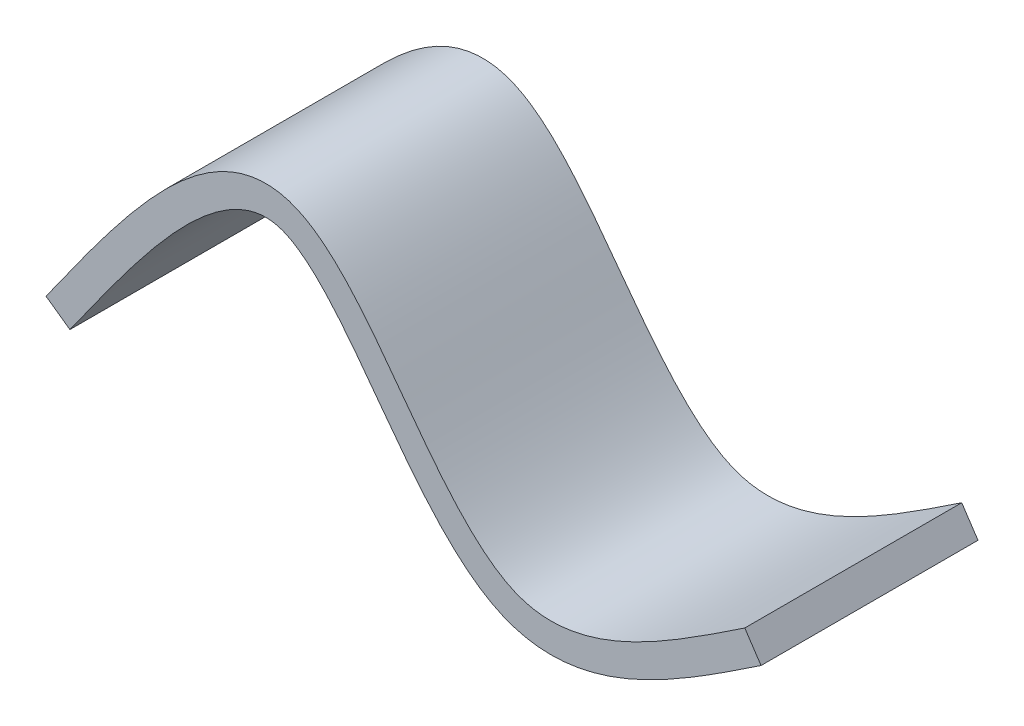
ISO-10303-21;
HEADER;
FILE_DESCRIPTION(('STEP AP214'),'2;1');
FILE_NAME('part.step','',(''),(''),'','','');
FILE_SCHEMA(('AUTOMOTIVE_DESIGN { 1 0 10303 214 1 1 1 1 }'));
ENDSEC;
DATA;
#1=APPLICATION_CONTEXT('core data for automotive mechanical design processes');
#2=APPLICATION_PROTOCOL_DEFINITION('international standard','automotive_design',2000,#1);
#3=PRODUCT_CONTEXT('',#1,'mechanical');
#4=PRODUCT('Part','Part','',(#3));
#5=PRODUCT_RELATED_PRODUCT_CATEGORY('part','',(#4));
#6=PRODUCT_DEFINITION_FORMATION('','',#4);
#7=PRODUCT_DEFINITION_CONTEXT('part definition',#1,'design');
#8=PRODUCT_DEFINITION('design','',#6,#7);
#9=PRODUCT_DEFINITION_SHAPE('','',#8);
#10=(LENGTH_UNIT() NAMED_UNIT(*) SI_UNIT(.MILLI.,.METRE.));
#11=(NAMED_UNIT(*) PLANE_ANGLE_UNIT() SI_UNIT($,.RADIAN.));
#12=(NAMED_UNIT(*) SI_UNIT($,.STERADIAN.) SOLID_ANGLE_UNIT());
#13=UNCERTAINTY_MEASURE_WITH_UNIT(LENGTH_MEASURE(1.E-05),#10,'distance_accuracy_value','');
#14=(GEOMETRIC_REPRESENTATION_CONTEXT(3) GLOBAL_UNCERTAINTY_ASSIGNED_CONTEXT((#13)) GLOBAL_UNIT_ASSIGNED_CONTEXT((#10,
#11,#12)) REPRESENTATION_CONTEXT('',''));
#15=CARTESIAN_POINT('',(0.,0.,0.));
#16=DIRECTION('',(0.,0.,1.));
#17=DIRECTION('',(1.,0.,0.));
#18=AXIS2_PLACEMENT_3D('',#15,#16,#17);
#19=CARTESIAN_POINT('',(-8.1111552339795,6.10642845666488,0.));
#20=DIRECTION('',(0.,0.,-1.));
#21=DIRECTION('',(-1.,0.,0.));
#22=AXIS2_PLACEMENT_3D('',#19,#20,#21);
#23=PLANE('',#22);
#24=DIRECTION('',(0.815720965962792,-0.578445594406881,0.));
#25=VECTOR('',#24,1.);
#26=CARTESIAN_POINT('',(-123.895256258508,-15.3748979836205,0.));
#27=LINE('',#26,#25);
#28=CARTESIAN_POINT('',(-127.973861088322,-12.4826700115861,0.));
#29=VERTEX_POINT('',#28);
#30=CARTESIAN_POINT('',(-119.816651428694,-18.267125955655,0.));
#31=VERTEX_POINT('',#30);
#32=EDGE_CURVE('E11',#29,#31,#27,.T.);
#33=ORIENTED_EDGE('',*,*,#32,.F.);
#34=CARTESIAN_POINT('',(-127.973861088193,-12.4826700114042,0.));
#35=CARTESIAN_POINT('',(-126.763082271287,-10.7752268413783,0.));
#36=CARTESIAN_POINT('',(-125.552306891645,-9.06779233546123,0.));
#37=CARTESIAN_POINT('',(-123.129189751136,-5.65844526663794,0.));
#38=CARTESIAN_POINT('',(-121.916854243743,-3.9565282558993,0.));
#39=CARTESIAN_POINT('',(-118.291522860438,1.10994318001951,0.));
#40=CARTESIAN_POINT('',(-115.8678905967,4.46696472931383,0.));
#41=CARTESIAN_POINT('',(-112.206936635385,9.44283638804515,0.));
#42=CARTESIAN_POINT('',(-110.992380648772,11.0784046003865,0.));
#43=CARTESIAN_POINT('',(-108.562745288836,14.3107439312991,0.));
#44=CARTESIAN_POINT('',(-107.347950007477,15.9077281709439,0.));
#45=CARTESIAN_POINT('',(-104.917809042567,19.0546841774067,0.));
#46=CARTESIAN_POINT('',(-103.702884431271,20.6049803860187,0.));
#47=CARTESIAN_POINT('',(-101.27224848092,23.6503566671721,0.));
#48=CARTESIAN_POINT('',(-100.057125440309,25.1459051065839,0.));
#49=CARTESIAN_POINT('',(-97.6256389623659,28.0736187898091,0.));
#50=CARTESIAN_POINT('',(-96.4100613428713,29.5064347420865,0.));
#51=CARTESIAN_POINT('',(-93.9769273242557,32.30052885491,0.));
#52=CARTESIAN_POINT('',(-92.7603838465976,33.662686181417,0.));
#53=CARTESIAN_POINT('',(-90.3242068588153,36.3073123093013,0.));
#54=CARTESIAN_POINT('',(-89.1058394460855,37.5909423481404,0.));
#55=CARTESIAN_POINT('',(-86.6644696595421,40.0702584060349,0.));
#56=CARTESIAN_POINT('',(-85.4430023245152,41.2674502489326,0.));
#57=CARTESIAN_POINT('',(-82.9931886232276,43.5656327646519,0.));
#58=CARTESIAN_POINT('',(-81.7666492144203,44.668532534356,0.));
#59=CARTESIAN_POINT('',(-79.9023401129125,46.2587356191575,0.));
#60=CARTESIAN_POINT('',(-79.2859188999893,46.7711283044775,0.));
#61=CARTESIAN_POINT('',(-78.0505011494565,47.7687434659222,0.));
#62=CARTESIAN_POINT('',(-77.4317719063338,48.2542959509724,0.));
#63=CARTESIAN_POINT('',(-76.191295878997,49.1970645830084,0.));
#64=CARTESIAN_POINT('',(-75.5698238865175,49.6546416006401,0.));
#65=CARTESIAN_POINT('',(-74.3233441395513,50.5402239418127,0.));
#66=CARTESIAN_POINT('',(-73.6986144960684,50.9686197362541,0.));
#67=CARTESIAN_POINT('',(-72.4450640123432,51.7945168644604,0.));
#68=CARTESIAN_POINT('',(-71.8165186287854,52.1924351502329,0.));
#69=CARTESIAN_POINT('',(-70.5547515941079,52.9559414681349,0.));
#70=CARTESIAN_POINT('',(-69.9217957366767,53.3219674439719,0.));
#71=CARTESIAN_POINT('',(-68.6506128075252,54.0201158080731,0.));
#72=CARTESIAN_POINT('',(-68.0126340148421,54.3526886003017,0.));
#73=CARTESIAN_POINT('',(-66.7308643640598,54.9821837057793,0.));
#74=CARTESIAN_POINT('',(-66.0872956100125,55.2795569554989,0.));
#75=CARTESIAN_POINT('',(-64.793821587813,55.8367406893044,0.));
#76=CARTESIAN_POINT('',(-64.1441053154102,56.0969864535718,0.));
#77=CARTESIAN_POINT('',(-63.1621017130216,56.4584906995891,0.));
#78=CARTESIAN_POINT('',(-62.8349251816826,56.5737548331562,0.));
#79=CARTESIAN_POINT('',(-62.1789307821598,56.7941240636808,0.));
#80=CARTESIAN_POINT('',(-61.8501287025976,56.899275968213,0.));
#81=CARTESIAN_POINT('',(-61.1908953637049,57.0991183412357,0.));
#82=CARTESIAN_POINT('',(-60.8604771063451,57.1938516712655,0.));
#83=CARTESIAN_POINT('',(-60.1980336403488,57.3725494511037,0.));
#84=CARTESIAN_POINT('',(-59.8660187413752,57.4565520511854,0.));
#85=CARTESIAN_POINT('',(-59.2004335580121,57.6134716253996,0.));
#86=CARTESIAN_POINT('',(-58.8668709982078,57.6864213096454,0.));
#87=CARTESIAN_POINT('',(-58.198270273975,57.8209137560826,0.));
#88=CARTESIAN_POINT('',(-57.863237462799,57.8824830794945,0.));
#89=CARTESIAN_POINT('',(-57.1918080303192,57.9938922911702,0.));
#90=CARTESIAN_POINT('',(-56.8554146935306,58.0437519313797,0.));
#91=CARTESIAN_POINT('',(-56.1814097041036,58.1314227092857,0.));
#92=CARTESIAN_POINT('',(-55.8437996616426,58.1692461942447,0.));
#93=CARTESIAN_POINT('',(-55.1675415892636,58.2325341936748,0.));
#94=CARTESIAN_POINT('',(-54.8288939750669,58.2580031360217,0.));
#95=CARTESIAN_POINT('',(-54.1507757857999,58.2962858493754,0.));
#96=CARTESIAN_POINT('',(-53.8113049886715,58.3090957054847,0.));
#97=CARTESIAN_POINT('',(-53.1317886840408,58.3217842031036,0.));
#98=CARTESIAN_POINT('',(-52.7917429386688,58.3216502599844,0.));
#99=CARTESIAN_POINT('',(-52.1113552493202,58.3082010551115,0.));
#100=CARTESIAN_POINT('',(-51.7710137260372,58.29486430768,0.));
#101=CARTESIAN_POINT('',(-51.0903387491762,58.2547907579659,0.));
#102=CARTESIAN_POINT('',(-50.7500070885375,58.2280234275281,0.));
#103=CARTESIAN_POINT('',(-50.0696760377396,58.1609055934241,0.));
#104=CARTESIAN_POINT('',(-49.7296805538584,58.1205154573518,0.));
#105=CARTESIAN_POINT('',(-49.0503585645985,58.0260089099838,0.));
#106=CARTESIAN_POINT('',(-48.7110388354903,57.9718437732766,0.));
#107=CARTESIAN_POINT('',(-48.0334107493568,57.8496820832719,0.));
#108=CARTESIAN_POINT('',(-47.6951128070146,57.7816277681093,0.));
#109=CARTESIAN_POINT('',(-47.0198635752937,57.6316355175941,0.));
#110=CARTESIAN_POINT('',(-46.6829270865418,57.54963096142,0.));
#111=CARTESIAN_POINT('',(-46.0109999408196,57.3717515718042,0.));
#112=CARTESIAN_POINT('',(-45.6760264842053,57.2758118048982,0.));
#113=CARTESIAN_POINT('',(-45.0097857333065,57.0707491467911,0.));
#114=CARTESIAN_POINT('',(-44.6785224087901,56.9616133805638,0.));
#115=CARTESIAN_POINT('',(-44.0199862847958,56.7308404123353,0.));
#116=CARTESIAN_POINT('',(-43.6927181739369,56.6091898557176,0.));
#117=CARTESIAN_POINT('',(-43.042155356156,56.3539453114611,0.));
#118=CARTESIAN_POINT('',(-42.7188694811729,56.2203288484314,0.));
#119=CARTESIAN_POINT('',(-42.0762037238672,55.9416951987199,0.));
#120=CARTESIAN_POINT('',(-41.7568369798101,55.7966477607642,0.));
#121=CARTESIAN_POINT('',(-41.1219011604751,55.4956587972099,0.));
#122=CARTESIAN_POINT('',(-40.8063494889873,55.3396805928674,0.));
#123=CARTESIAN_POINT('',(-40.1789181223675,55.0173116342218,0.));
#124=CARTESIAN_POINT('',(-39.8670599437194,54.8508791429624,0.));
#125=CARTESIAN_POINT('',(-38.9342441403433,54.3352397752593,0.));
#126=CARTESIAN_POINT('',(-38.3209710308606,53.9720450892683,0.));
#127=CARTESIAN_POINT('',(-37.1070276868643,53.2092005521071,0.));
#128=CARTESIAN_POINT('',(-36.5066090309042,52.8091535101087,0.));
#129=CARTESIAN_POINT('',(-35.3168118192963,51.975341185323,0.));
#130=CARTESIAN_POINT('',(-34.7277158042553,51.5411740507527,0.));
#131=CARTESIAN_POINT('',(-33.5591313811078,50.6415496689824,0.));
#132=CARTESIAN_POINT('',(-32.9799408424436,50.1757070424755,0.));
#133=CARTESIAN_POINT('',(-31.829827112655,49.214889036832,0.));
#134=CARTESIAN_POINT('',(-31.2592023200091,48.719557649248,0.));
#135=CARTESIAN_POINT('',(-30.1250143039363,47.7017429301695,0.));
#136=CARTESIAN_POINT('',(-29.5617385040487,47.1789402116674,0.));
#137=CARTESIAN_POINT('',(-28.4412074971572,46.108033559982,0.));
#138=CARTESIAN_POINT('',(-27.8842208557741,45.5596495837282,0.));
#139=CARTESIAN_POINT('',(-26.2071026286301,43.8654479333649,0.));
#140=CARTESIAN_POINT('',(-25.1098244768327,42.6969893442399,0.));
#141=CARTESIAN_POINT('',(-22.9287007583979,40.2810550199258,0.));
#142=CARTESIAN_POINT('',(-21.8463431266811,39.0322513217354,0.));
#143=CARTESIAN_POINT('',(-19.6904684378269,36.4688198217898,0.));
#144=CARTESIAN_POINT('',(-18.617987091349,35.1533253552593,0.));
#145=CARTESIAN_POINT('',(-16.4783403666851,32.4701088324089,0.));
#146=CARTESIAN_POINT('',(-15.4118200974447,31.1018754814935,0.));
#147=CARTESIAN_POINT('',(-13.2812631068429,28.3269807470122,0.));
#148=CARTESIAN_POINT('',(-12.2175662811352,26.9200593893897,0.));
#149=CARTESIAN_POINT('',(-9.01518192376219,22.6481541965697,0.));
#150=CARTESIAN_POINT('',(-6.89449927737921,19.7698008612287,0.));
#151=CARTESIAN_POINT('',(-2.63817793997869,14.032982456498,0.));
#152=CARTESIAN_POINT('',(-0.502578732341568,11.1744887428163,0.));
#153=CARTESIAN_POINT('',(2.74612015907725,6.9595615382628,0.));
#154=CARTESIAN_POINT('',(3.82696553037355,5.57844367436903,0.));
#155=CARTESIAN_POINT('',(5.99633292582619,2.86693785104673,0.));
#156=CARTESIAN_POINT('',(7.0842743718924,1.53608728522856,0.));
#157=CARTESIAN_POINT('',(9.2684651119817,-1.05928381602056,0.));
#158=CARTESIAN_POINT('',(10.3637305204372,-2.32462752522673,0.));
#159=CARTESIAN_POINT('',(12.5627605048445,-4.77314678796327,0.));
#160=CARTESIAN_POINT('',(13.6650332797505,-5.9576555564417,0.));
#161=CARTESIAN_POINT('',(15.8777889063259,-8.22887029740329,0.));
#162=CARTESIAN_POINT('',(16.9861787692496,-9.31759319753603,0.));
#163=CARTESIAN_POINT('',(18.6741179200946,-10.8840732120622,0.));
#164=CARTESIAN_POINT('',(19.2307123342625,-11.386608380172,0.));
#165=CARTESIAN_POINT('',(20.3450797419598,-12.3617003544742,0.));
#166=CARTESIAN_POINT('',(20.9024696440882,-12.8346934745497,0.));
#167=CARTESIAN_POINT('',(22.0180876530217,-13.7489388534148,0.));
#168=CARTESIAN_POINT('',(22.5758966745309,-14.1907012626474,0.));
#169=CARTESIAN_POINT('',(23.6919976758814,-15.0408133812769,0.));
#170=CARTESIAN_POINT('',(24.2498396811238,-15.4497520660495,0.));
#171=CARTESIAN_POINT('',(25.3656178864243,-16.2326687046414,0.));
#172=CARTESIAN_POINT('',(25.9230825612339,-16.6073164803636,0.));
#173=CARTESIAN_POINT('',(27.0377172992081,-17.3202670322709,0.));
#174=CARTESIAN_POINT('',(27.5944073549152,-17.6593174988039,0.));
#175=CARTESIAN_POINT('',(28.7071573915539,-18.2998543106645,0.));
#176=CARTESIAN_POINT('',(29.262745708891,-18.6021568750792,0.));
#177=CARTESIAN_POINT('',(30.373023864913,-19.168283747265,0.));
#178=CARTESIAN_POINT('',(30.9272721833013,-19.4329699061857,0.));
#179=CARTESIAN_POINT('',(32.0354484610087,-19.9231023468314,0.));
#180=CARTESIAN_POINT('',(32.5889977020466,-20.1494008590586,0.));
#181=CARTESIAN_POINT('',(33.7008749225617,-20.5651587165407,0.));
#182=CARTESIAN_POINT('',(34.259025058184,-20.7550931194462,0.));
#183=CARTESIAN_POINT('',(35.3818811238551,-21.1004833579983,0.));
#184=CARTESIAN_POINT('',(35.9465201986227,-21.2561568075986,0.));
#185=CARTESIAN_POINT('',(37.0832277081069,-21.5342604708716,0.));
#186=CARTESIAN_POINT('',(37.6552868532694,-21.6567287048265,0.));
#187=CARTESIAN_POINT('',(38.8076185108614,-21.8695423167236,0.));
#188=CARTESIAN_POINT('',(39.387914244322,-21.9597615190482,0.));
#189=CARTESIAN_POINT('',(40.5574156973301,-22.1089855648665,0.));
#190=CARTESIAN_POINT('',(41.1466553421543,-22.1677229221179,0.));
#191=CARTESIAN_POINT('',(42.3346034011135,-22.2547457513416,0.));
#192=CARTESIAN_POINT('',(42.9333394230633,-22.2826496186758,0.));
#193=CARTESIAN_POINT('',(44.1406846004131,-22.3086545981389,0.));
#194=CARTESIAN_POINT('',(44.7493033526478,-22.3062885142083,0.));
#195=CARTESIAN_POINT('',(45.9766578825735,-22.2723335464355,0.));
#196=CARTESIAN_POINT('',(46.5953785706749,-22.2402194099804,0.));
#197=CARTESIAN_POINT('',(47.8430280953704,-22.1473165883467,0.));
#198=CARTESIAN_POINT('',(48.4719147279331,-22.0859693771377,0.));
#199=CARTESIAN_POINT('',(49.7398506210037,-21.9351485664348,0.));
#200=CARTESIAN_POINT('',(50.3788313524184,-21.8451042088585,0.));
#201=CARTESIAN_POINT('',(51.6667942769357,-21.637460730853,0.));
#202=CARTESIAN_POINT('',(52.315684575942,-21.5192955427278,0.));
#203=CARTESIAN_POINT('',(53.6232131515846,-21.2560216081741,0.));
#204=CARTESIAN_POINT('',(54.2817403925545,-21.1103643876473,0.));
#205=CARTESIAN_POINT('',(55.6082172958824,-20.7927660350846,0.));
#206=CARTESIAN_POINT('',(56.2760414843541,-20.6203032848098,0.));
#207=CARTESIAN_POINT('',(57.6207421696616,-20.2498077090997,0.));
#208=CARTESIAN_POINT('',(58.2974836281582,-20.0512863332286,0.));
#209=CARTESIAN_POINT('',(59.6595924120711,-19.6294349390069,0.));
#210=CARTESIAN_POINT('',(60.3448190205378,-19.4056529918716,0.));
#211=CARTESIAN_POINT('',(62.4346892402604,-18.6908911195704,0.));
#212=CARTESIAN_POINT('',(63.8288206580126,-18.1690201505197,0.));
#213=CARTESIAN_POINT('',(66.6467649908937,-17.0380382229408,0.));
#214=CARTESIAN_POINT('',(68.0694877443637,-16.4262470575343,0.));
#215=CARTESIAN_POINT('',(70.9413372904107,-15.1227018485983,0.));
#216=CARTESIAN_POINT('',(72.3894965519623,-14.4288281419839,0.));
#217=CARTESIAN_POINT('',(75.308941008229,-12.9689332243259,0.));
#218=CARTESIAN_POINT('',(76.7794076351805,-12.2012850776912,0.));
#219=CARTESIAN_POINT('',(79.7404567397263,-10.6019678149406,0.));
#220=CARTESIAN_POINT('',(81.230381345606,-9.76908632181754,0.));
#221=CARTESIAN_POINT('',(84.227559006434,-8.04767625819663,0.));
#222=CARTESIAN_POINT('',(85.7343092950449,-7.1582759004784,0.));
#223=CARTESIAN_POINT('',(88.7625830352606,-5.33236849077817,0.));
#224=CARTESIAN_POINT('',(90.2837442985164,-4.39526285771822,0.));
#225=CARTESIAN_POINT('',(93.3384963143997,-2.48260383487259,0.));
#226=CARTESIAN_POINT('',(94.8718453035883,-1.50666553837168,0.));
#227=CARTESIAN_POINT('',(97.94882165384,0.474925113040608,0.));
#228=CARTESIAN_POINT('',(99.4923045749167,1.48080113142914,0.));
#229=CARTESIAN_POINT('',(102.587582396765,3.51345971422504,0.));
#230=CARTESIAN_POINT('',(104.139305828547,4.54035076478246,0.));
#231=CARTESIAN_POINT('',(107.249237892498,6.6062665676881,0.));
#232=CARTESIAN_POINT('',(108.807422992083,7.64532679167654,0.));
#233=CARTESIAN_POINT('',(110.36564014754,8.68429951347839,0.));
#234=B_SPLINE_CURVE_WITH_KNOTS('',3,(#34,#35,#36,#37,#38,#39,#40,#41,#42,#43,#44,#45,#46,#47,
#48,#49,#50,#51,#52,#53,#54,#55,#56,#57,#58,#59,#60,#61,#62,#63,#64,#65,#66,#67,#68,#69,#70,#71,
#72,#73,#74,#75,#76,#77,#78,#79,#80,#81,#82,#83,#84,#85,#86,#87,#88,#89,#90,#91,#92,#93,#94,#95,
#96,#97,#98,#99,#100,#101,#102,#103,#104,#105,#106,#107,#108,#109,#110,#111,#112,#113,#114,#115,
#116,#117,#118,#119,#120,#121,#122,#123,#124,#125,#126,#127,#128,#129,#130,#131,#132,#133,#134,
#135,#136,#137,#138,#139,#140,#141,#142,#143,#144,#145,#146,#147,#148,#149,#150,#151,#152,#153,
#154,#155,#156,#157,#158,#159,#160,#161,#162,#163,#164,#165,#166,#167,#168,#169,#170,#171,#172,
#173,#174,#175,#176,#177,#178,#179,#180,#181,#182,#183,#184,#185,#186,#187,#188,#189,#190,#191,
#192,#193,#194,#195,#196,#197,#198,#199,#200,#201,#202,#203,#204,#205,#206,#207,#208,#209,#210,
#211,#212,#213,#214,#215,#216,#217,#218,#219,#220,#221,#222,#223,#224,#225,#226,#227,#228,#229,
#230,#231,#232,#233),.UNSPECIFIED.,.F.,.F.,(4,2,2,2,2,2,2,2,2,2,2,2,2,2,2,2,2,2,2,2,2,2,2,2,2,2,
2,2,2,2,2,2,2,2,2,2,2,2,2,2,2,2,2,2,2,2,2,2,2,2,2,2,2,2,2,2,2,2,2,2,2,2,2,2,2,2,2,2,2,2,2,2,2,2,
2,2,2,2,2,2,2,2,2,2,2,2,2,2,2,2,2,2,2,2,2,2,2,2,2,4),(0.,6.27947969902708,12.548183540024,
24.969182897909,31.0807113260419,37.100077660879,43.0087323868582,48.7892653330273,
54.4257185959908,59.9039892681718,65.2123492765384,70.3421143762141,75.2884947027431,
77.6929558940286,80.0521189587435,82.3669855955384,84.6390271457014,86.8702230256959,
89.0630921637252,91.2207122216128,93.3467202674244,95.4452881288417,96.4858255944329,
97.521287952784,98.5523171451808,99.5795722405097,100.603725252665,101.625456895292,
102.645452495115,103.664398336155,104.682978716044,105.701873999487,106.7217599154,
107.743308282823,108.767189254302,109.794075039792,110.824644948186,111.859591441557,
112.899626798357,113.944673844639,114.990748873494,116.037951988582,117.087165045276,
118.139254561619,119.195061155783,120.255389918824,122.392398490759,124.555983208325,
126.750651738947,128.979918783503,131.246317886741,133.551456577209,135.896095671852,
140.702906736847,145.659731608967,150.75097722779,155.955107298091,161.246279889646,
171.972003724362,182.675780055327,187.936792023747,193.0931319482,198.112850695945,
202.965767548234,207.624519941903,209.873904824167,212.066610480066,214.200817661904,
216.275325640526,218.289695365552,220.244421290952,222.141132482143,223.98281928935,
225.775829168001,227.543521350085,229.299639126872,231.053737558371,232.814625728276,
234.59024723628,236.387606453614,238.212739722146,240.070725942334,241.965728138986,
243.901056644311,245.879245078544,247.90213175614,249.970940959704,252.086360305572,
254.248611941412,258.712171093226,263.356801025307,268.173092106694,273.148631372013,
278.268809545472,283.517418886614,288.877104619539,294.329715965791,299.856589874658,
305.438791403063,311.057328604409),.UNSPECIFIED.);
#235=CARTESIAN_POINT('',(110.36564014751,8.68429951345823,0.));
#236=VERTEX_POINT('',#235);
#237=EDGE_CURVE('E67',#29,#236,#234,.T.);
#238=ORIENTED_EDGE('',*,*,#237,.T.);
#239=DIRECTION('',(0.554781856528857,-0.83199584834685,0.));
#240=VECTOR('',#239,1.);
#241=CARTESIAN_POINT('',(113.139549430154,4.52432027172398,0.));
#242=LINE('',#241,#240);
#243=CARTESIAN_POINT('',(115.913458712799,0.364341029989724,0.));
#244=VERTEX_POINT('',#243);
#245=EDGE_CURVE('E44',#236,#244,#242,.T.);
#246=ORIENTED_EDGE('',*,*,#245,.T.);
#247=CARTESIAN_POINT('',(-119.816651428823,-18.2671259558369,0.));
#248=CARTESIAN_POINT('',(-118.607902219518,-16.5626077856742,0.));
#249=CARTESIAN_POINT('',(-117.399193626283,-14.8580497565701,0.));
#250=CARTESIAN_POINT('',(-114.984360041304,-11.4603019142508,0.));
#251=CARTESIAN_POINT('',(-113.778253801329,-9.76709876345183,0.));
#252=CARTESIAN_POINT('',(-111.369240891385,-6.40055292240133,0.));
#253=CARTESIAN_POINT('',(-110.16639712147,-4.72716530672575,0.));
#254=CARTESIAN_POINT('',(-107.764532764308,-1.40884457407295,0.));
#255=CARTESIAN_POINT('',(-106.565646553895,0.236185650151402,0.));
#256=CARTESIAN_POINT('',(-104.172380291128,3.48913390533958,0.));
#257=CARTESIAN_POINT('',(-102.978235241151,5.09722451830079,0.));
#258=CARTESIAN_POINT('',(-100.59519482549,8.26755390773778,0.));
#259=CARTESIAN_POINT('',(-99.4066672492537,9.83006858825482,0.));
#260=CARTESIAN_POINT('',(-97.0356875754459,12.9004190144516,0.));
#261=CARTESIAN_POINT('',(-95.8537718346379,14.4086680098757,0.));
#262=CARTESIAN_POINT('',(-93.4969500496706,17.3615614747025,0.));
#263=CARTESIAN_POINT('',(-92.3227891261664,18.8067991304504,0.));
#264=CARTESIAN_POINT('',(-89.9825566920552,21.6246377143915,0.));
#265=CARTESIAN_POINT('',(-88.8174842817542,22.9980658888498,0.));
#266=CARTESIAN_POINT('',(-86.496709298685,25.6631348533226,0.));
#267=CARTESIAN_POINT('',(-85.3423101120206,26.9559067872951,0.));
#268=CARTESIAN_POINT('',(-83.0444248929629,29.4504137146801,0.));
#269=CARTESIAN_POINT('',(-81.9026016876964,30.6536735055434,0.));
#270=CARTESIAN_POINT('',(-79.6318063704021,32.9597668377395,0.));
#271=CARTESIAN_POINT('',(-78.5049120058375,34.0646381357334,0.));
#272=CARTESIAN_POINT('',(-76.2663105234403,36.1647021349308,0.));
#273=CARTESIAN_POINT('',(-75.1571533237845,37.162587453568,0.));
#274=CARTESIAN_POINT('',(-73.4809223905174,38.5923468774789,0.));
#275=CARTESIAN_POINT('',(-72.933583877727,39.0474038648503,0.));
#276=CARTESIAN_POINT('',(-71.844320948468,39.9270007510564,0.));
#277=CARTESIAN_POINT('',(-71.302810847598,40.3520521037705,0.));
#278=CARTESIAN_POINT('',(-70.2257733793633,41.1706063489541,0.));
#279=CARTESIAN_POINT('',(-69.6906899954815,41.5646921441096,0.));
#280=CARTESIAN_POINT('',(-68.6271031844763,42.3203359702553,0.));
#281=CARTESIAN_POINT('',(-68.099071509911,42.6825561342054,0.));
#282=CARTESIAN_POINT('',(-67.050242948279,43.3735736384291,0.));
#283=CARTESIAN_POINT('',(-66.5299405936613,43.7031192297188,0.));
#284=CARTESIAN_POINT('',(-65.4972656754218,44.3280006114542,0.));
#285=CARTESIAN_POINT('',(-64.9854031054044,44.6241762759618,0.));
#286=CARTESIAN_POINT('',(-63.9703182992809,45.1816733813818,0.));
#287=CARTESIAN_POINT('',(-63.4676112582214,45.4439287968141,0.));
#288=CARTESIAN_POINT('',(-62.4715503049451,45.9331085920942,0.));
#289=CARTESIAN_POINT('',(-61.9787021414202,46.1610589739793,0.));
#290=CARTESIAN_POINT('',(-61.0029463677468,46.5813823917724,0.));
#291=CARTESIAN_POINT('',(-60.5205200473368,46.7748625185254,0.));
#292=CARTESIAN_POINT('',(-59.7970739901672,47.0411806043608,0.));
#293=CARTESIAN_POINT('',(-59.5599724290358,47.1247438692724,0.));
#294=CARTESIAN_POINT('',(-59.0884913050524,47.2831298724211,0.));
#295=CARTESIAN_POINT('',(-58.8541618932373,47.3581012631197,0.));
#296=CARTESIAN_POINT('',(-58.3882531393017,47.4993383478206,0.));
#297=CARTESIAN_POINT('',(-58.1567192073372,47.5657536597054,0.));
#298=CARTESIAN_POINT('',(-57.6963986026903,47.6899277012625,0.));
#299=CARTESIAN_POINT('',(-57.4676521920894,47.7478353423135,0.));
#300=CARTESIAN_POINT('',(-57.012880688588,47.8550530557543,0.));
#301=CARTESIAN_POINT('',(-56.7868901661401,47.9045094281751,0.));
#302=CARTESIAN_POINT('',(-56.3375751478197,47.9948913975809,0.));
#303=CARTESIAN_POINT('',(-56.114279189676,48.0359584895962,0.));
#304=CARTESIAN_POINT('',(-55.6702664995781,48.1096327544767,0.));
#305=CARTESIAN_POINT('',(-55.4495721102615,48.1423741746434,0.));
#306=CARTESIAN_POINT('',(-55.0106417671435,48.1994677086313,0.));
#307=CARTESIAN_POINT('',(-54.7924220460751,48.2239441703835,0.));
#308=CARTESIAN_POINT('',(-54.3582849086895,48.264573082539,0.));
#309=CARTESIAN_POINT('',(-54.1423779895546,48.2808371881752,0.));
#310=CARTESIAN_POINT('',(-53.712674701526,48.3050957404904,0.));
#311=CARTESIAN_POINT('',(-53.4988837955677,48.3131863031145,0.));
#312=CARTESIAN_POINT('',(-53.0731862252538,48.3211352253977,0.));
#313=CARTESIAN_POINT('',(-52.8612810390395,48.3210713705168,0.));
#314=CARTESIAN_POINT('',(-52.4390966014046,48.3127260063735,0.));
#315=CARTESIAN_POINT('',(-52.2288162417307,48.3045013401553,0.));
#316=CARTESIAN_POINT('',(-51.8095952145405,48.2798203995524,0.));
#317=CARTESIAN_POINT('',(-51.6006525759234,48.263397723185,0.));
#318=CARTESIAN_POINT('',(-51.1837984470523,48.2222730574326,0.));
#319=CARTESIAN_POINT('',(-50.975886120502,48.1975795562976,0.));
#320=CARTESIAN_POINT('',(-50.5607682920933,48.1398289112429,0.));
#321=CARTESIAN_POINT('',(-50.3535652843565,48.1067538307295,0.));
#322=CARTESIAN_POINT('',(-49.9395349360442,48.0321126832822,0.));
#323=CARTESIAN_POINT('',(-49.7327157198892,47.9905015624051,0.));
#324=CARTESIAN_POINT('',(-49.319118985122,47.8986315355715,0.));
#325=CARTESIAN_POINT('',(-49.1123574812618,47.8483005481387,0.));
#326=CARTESIAN_POINT('',(-48.6983039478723,47.7386817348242,0.));
#327=CARTESIAN_POINT('',(-48.4910409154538,47.6792844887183,0.));
#328=CARTESIAN_POINT('',(-48.0742008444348,47.5509922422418,0.));
#329=CARTESIAN_POINT('',(-47.8646820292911,47.4819085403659,0.));
#330=CARTESIAN_POINT('',(-47.4429548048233,47.3341193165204,0.));
#331=CARTESIAN_POINT('',(-47.2308178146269,47.2552105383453,0.));
#332=CARTESIAN_POINT('',(-46.8038078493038,47.0876763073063,0.));
#333=CARTESIAN_POINT('',(-46.5890153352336,46.9988462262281,0.));
#334=CARTESIAN_POINT('',(-46.1566940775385,46.8114091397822,0.));
#335=CARTESIAN_POINT('',(-45.9392531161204,46.7126001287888,0.));
#336=CARTESIAN_POINT('',(-45.5016734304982,46.5051674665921,0.));
#337=CARTESIAN_POINT('',(-45.2816280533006,46.3963471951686,0.));
#338=CARTESIAN_POINT('',(-44.8389180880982,46.168885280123,0.));
#339=CARTESIAN_POINT('',(-44.6163509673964,46.0500546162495,0.));
#340=CARTESIAN_POINT('',(-43.9356518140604,45.6737868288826,0.));
#341=CARTESIAN_POINT('',(-43.4834298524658,45.4056046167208,0.));
#342=CARTESIAN_POINT('',(-42.5694800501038,44.8312719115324,0.));
#343=CARTESIAN_POINT('',(-42.1085564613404,44.523853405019,0.));
#344=CARTESIAN_POINT('',(-41.1781783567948,43.8718415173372,0.));
#345=CARTESIAN_POINT('',(-40.7094961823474,43.5261505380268,0.));
#346=CARTESIAN_POINT('',(-39.764627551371,42.7987498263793,0.));
#347=CARTESIAN_POINT('',(-39.2891623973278,42.4161075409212,0.));
#348=CARTESIAN_POINT('',(-38.3316647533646,41.6162013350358,0.));
#349=CARTESIAN_POINT('',(-37.8502889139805,41.1981543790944,0.));
#350=CARTESIAN_POINT('',(-36.88179341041,40.3290312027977,0.));
#351=CARTESIAN_POINT('',(-36.3952597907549,39.8773040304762,0.));
#352=CARTESIAN_POINT('',(-35.4171775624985,38.9425310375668,0.));
#353=CARTESIAN_POINT('',(-34.9261445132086,38.4589477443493,0.));
#354=CARTESIAN_POINT('',(-33.4217670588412,36.9392790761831,0.));
#355=CARTESIAN_POINT('',(-32.429709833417,35.8821169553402,0.));
#356=CARTESIAN_POINT('',(-30.4296562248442,33.6667046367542,0.));
#357=CARTESIAN_POINT('',(-29.4242109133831,32.5061792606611,0.));
#358=CARTESIAN_POINT('',(-27.3996579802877,30.0988929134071,0.));
#359=CARTESIAN_POINT('',(-26.3822773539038,28.8506871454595,0.));
#360=CARTESIAN_POINT('',(-24.3350181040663,26.2833101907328,0.));
#361=CARTESIAN_POINT('',(-23.3062238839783,24.9632796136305,0.));
#362=CARTESIAN_POINT('',(-21.2363910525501,22.2675089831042,0.));
#363=CARTESIAN_POINT('',(-20.1959560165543,20.8913076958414,0.));
#364=CARTESIAN_POINT('',(-18.1024049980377,18.0984055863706,0.));
#365=CARTESIAN_POINT('',(-17.0495550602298,16.681506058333,0.));
#366=CARTESIAN_POINT('',(-14.9301746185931,13.8223650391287,0.));
#367=CARTESIAN_POINT('',(-13.8636980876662,12.3800841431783,0.));
#368=CARTESIAN_POINT('',(-10.6324533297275,8.02532714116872,0.));
#369=CARTESIAN_POINT('',(-8.46021616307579,5.11820941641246,0.));
#370=CARTESIAN_POINT('',(-5.13749082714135,0.807088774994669,0.));
#371=CARTESIAN_POINT('',(-4.01924931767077,-0.621616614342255,0.));
#372=CARTESIAN_POINT('',(-1.76042621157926,-3.44490433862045,0.));
#373=CARTESIAN_POINT('',(-0.62005717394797,-4.83965604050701,0.));
#374=CARTESIAN_POINT('',(1.68643766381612,-7.58035550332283,0.));
#375=CARTESIAN_POINT('',(2.85211125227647,-8.92668170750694,0.));
#376=CARTESIAN_POINT('',(5.21326504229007,-11.5557128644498,0.));
#377=CARTESIAN_POINT('',(6.40800436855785,-12.8390800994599,0.));
#378=CARTESIAN_POINT('',(8.83224149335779,-15.3273376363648,0.));
#379=CARTESIAN_POINT('',(10.0606904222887,-16.5332393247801,0.));
#380=CARTESIAN_POINT('',(11.9430752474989,-18.280198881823,0.));
#381=CARTESIAN_POINT('',(12.5721790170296,-18.8480751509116,0.));
#382=CARTESIAN_POINT('',(13.8410662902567,-19.9583698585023,0.));
#383=CARTESIAN_POINT('',(14.4806719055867,-20.500990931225,0.));
#384=CARTESIAN_POINT('',(15.7713511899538,-21.5586990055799,0.));
#385=CARTESIAN_POINT('',(16.4222396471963,-22.0740115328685,0.));
#386=CARTESIAN_POINT('',(17.7363348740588,-23.0749309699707,0.));
#387=CARTESIAN_POINT('',(18.3993552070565,-23.5607819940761,0.));
#388=CARTESIAN_POINT('',(19.7385720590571,-24.5004803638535,0.));
#389=CARTESIAN_POINT('',(20.4145887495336,-24.9545832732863,0.));
#390=CARTESIAN_POINT('',(21.7806367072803,-25.828343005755,0.));
#391=CARTESIAN_POINT('',(22.4705035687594,-26.2482560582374,0.));
#392=CARTESIAN_POINT('',(23.8650320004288,-27.0509977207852,0.));
#393=CARTESIAN_POINT('',(24.5695536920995,-27.4340685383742,0.));
#394=CARTESIAN_POINT('',(25.994006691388,-28.1603791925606,0.));
#395=CARTESIAN_POINT('',(26.7138313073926,-28.5038274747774,0.));
#396=CARTESIAN_POINT('',(28.1688974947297,-29.1474310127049,0.));
#397=CARTESIAN_POINT('',(28.9040580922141,-29.4477686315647,0.));
#398=CARTESIAN_POINT('',(30.3846129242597,-30.0013363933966,0.));
#399=CARTESIAN_POINT('',(31.1298619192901,-30.254954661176,0.));
#400=CARTESIAN_POINT('',(32.6279505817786,-30.7157785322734,0.));
#401=CARTESIAN_POINT('',(33.380679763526,-30.9233436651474,0.));
#402=CARTESIAN_POINT('',(34.8923964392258,-31.2931923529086,0.));
#403=CARTESIAN_POINT('',(35.6513195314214,-31.4557394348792,0.));
#404=CARTESIAN_POINT('',(37.174139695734,-31.7369754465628,0.));
#405=CARTESIAN_POINT('',(37.9380054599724,-31.8558343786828,0.));
#406=CARTESIAN_POINT('',(39.4695756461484,-32.0512561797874,0.));
#407=CARTESIAN_POINT('',(40.237269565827,-32.127901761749,0.));
#408=CARTESIAN_POINT('',(41.775526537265,-32.2405858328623,0.));
#409=CARTESIAN_POINT('',(42.5460893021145,-32.2766282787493,0.));
#410=CARTESIAN_POINT('',(44.0892970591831,-32.3098668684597,0.));
#411=CARTESIAN_POINT('',(44.8619433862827,-32.3069985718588,0.));
#412=CARTESIAN_POINT('',(46.4087102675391,-32.2642066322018,0.));
#413=CARTESIAN_POINT('',(47.1828273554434,-32.2241615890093,0.));
#414=CARTESIAN_POINT('',(48.7320921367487,-32.1087995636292,0.));
#415=CARTESIAN_POINT('',(49.5072272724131,-32.0333160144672,0.));
#416=CARTESIAN_POINT('',(51.0582264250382,-31.8488247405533,0.));
#417=CARTESIAN_POINT('',(51.8340664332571,-31.7396167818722,0.));
#418=CARTESIAN_POINT('',(53.386289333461,-31.4893696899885,0.));
#419=CARTESIAN_POINT('',(54.1626360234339,-31.3481073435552,0.));
#420=CARTESIAN_POINT('',(55.7157762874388,-31.0353789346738,0.));
#421=CARTESIAN_POINT('',(56.4925219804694,-30.8636761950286,0.));
#422=CARTESIAN_POINT('',(58.0464275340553,-30.4916248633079,0.));
#423=CARTESIAN_POINT('',(58.8235292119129,-30.2910342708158,0.));
#424=CARTESIAN_POINT('',(60.3781648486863,-29.8626963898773,0.));
#425=CARTESIAN_POINT('',(61.1556323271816,-29.6347084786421,0.));
#426=CARTESIAN_POINT('',(62.7110179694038,-29.1530007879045,0.));
#427=CARTESIAN_POINT('',(63.4888633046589,-28.8990470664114,0.));
#428=CARTESIAN_POINT('',(65.8352459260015,-28.0965416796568,0.));
#429=CARTESIAN_POINT('',(67.3922828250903,-27.514169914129,0.));
#430=CARTESIAN_POINT('',(70.508882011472,-26.2633337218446,0.));
#431=CARTESIAN_POINT('',(72.0678160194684,-25.5933234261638,0.));
#432=CARTESIAN_POINT('',(75.1886405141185,-24.1767692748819,0.));
#433=CARTESIAN_POINT('',(76.749947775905,-23.4289472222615,0.));
#434=CARTESIAN_POINT('',(79.8754899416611,-21.8659949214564,0.));
#435=CARTESIAN_POINT('',(81.4392176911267,-21.0498563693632,0.));
#436=CARTESIAN_POINT('',(84.5693358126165,-19.3592224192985,0.));
#437=CARTESIAN_POINT('',(86.1353141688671,-18.4839675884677,0.));
#438=CARTESIAN_POINT('',(89.269399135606,-16.6839325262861,0.));
#439=CARTESIAN_POINT('',(90.8371933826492,-15.7586105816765,0.));
#440=CARTESIAN_POINT('',(93.9741265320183,-13.8671672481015,0.));
#441=CARTESIAN_POINT('',(95.543047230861,-12.9006852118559,0.));
#442=CARTESIAN_POINT('',(100.268012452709,-9.94238180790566,0.));
#443=CARTESIAN_POINT('',(103.401932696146,-7.91533749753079,0.));
#444=CARTESIAN_POINT('',(108.091486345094,-4.83558778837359,0.));
#445=CARTESIAN_POINT('',(109.657896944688,-3.79901242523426,0.));
#446=CARTESIAN_POINT('',(112.787353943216,-1.72018463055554,0.));
#447=CARTESIAN_POINT('',(114.35039969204,-0.677931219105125,0.));
#448=CARTESIAN_POINT('',(115.913458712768,0.364341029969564,0.));
#449=B_SPLINE_CURVE_WITH_KNOTS('',3,(#247,#248,#249,#250,#251,#252,#253,#254,#255,#256,#257,
#258,#259,#260,#261,#262,#263,#264,#265,#266,#267,#268,#269,#270,#271,#272,#273,#274,#275,#276,
#277,#278,#279,#280,#281,#282,#283,#284,#285,#286,#287,#288,#289,#290,#291,#292,#293,#294,#295,
#296,#297,#298,#299,#300,#301,#302,#303,#304,#305,#306,#307,#308,#309,#310,#311,#312,#313,#314,
#315,#316,#317,#318,#319,#320,#321,#322,#323,#324,#325,#326,#327,#328,#329,#330,#331,#332,#333,
#334,#335,#336,#337,#338,#339,#340,#341,#342,#343,#344,#345,#346,#347,#348,#349,#350,#351,#352,
#353,#354,#355,#356,#357,#358,#359,#360,#361,#362,#363,#364,#365,#366,#367,#368,#369,#370,#371,
#372,#373,#374,#375,#376,#377,#378,#379,#380,#381,#382,#383,#384,#385,#386,#387,#388,#389,#390,
#391,#392,#393,#394,#395,#396,#397,#398,#399,#400,#401,#402,#403,#404,#405,#406,#407,#408,#409,
#410,#411,#412,#413,#414,#415,#416,#417,#418,#419,#420,#421,#422,#423,#424,#425,#426,#427,#428,
#429,#430,#431,#432,#433,#434,#435,#436,#437,#438,#439,#440,#441,#442,#443,#444,#445,#446,#447,
#448),.UNSPECIFIED.,.F.,.F.,(4,2,2,2,2,2,2,2,2,2,2,2,2,2,2,2,2,2,2,2,2,2,2,2,2,2,2,2,2,2,2,2,2,
2,2,2,2,2,2,2,2,2,2,2,2,2,2,2,2,2,2,2,2,2,2,2,2,2,2,2,2,2,2,2,2,2,2,2,2,2,2,2,2,2,2,2,2,2,2,2,2,
2,2,2,2,2,2,2,2,2,2,2,2,2,2,2,2,2,2,2,4),(0.,6.26883582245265,12.5053875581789,18.6878759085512,
24.79445806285,30.8033013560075,36.6926589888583,42.4409523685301,48.0268658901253,
53.4294623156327,58.6283310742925,63.603789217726,68.3371680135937,72.8112419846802,
74.9464020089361,77.0113156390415,79.0046056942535,80.9251986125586,82.7724030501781,
84.5460104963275,86.2464227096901,87.8748103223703,89.4333050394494,90.1874034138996,
90.9253825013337,91.6478825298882,92.3556488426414,93.0495391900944,93.7305301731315,
94.3997224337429,95.0583441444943,95.7077523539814,96.3494317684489,96.9849906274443,
97.6161534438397,98.244750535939,98.8727044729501,99.5020137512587,100.134734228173,
100.772958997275,101.419604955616,102.081284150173,102.760143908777,103.457308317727,
104.173690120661,104.910010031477,105.666816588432,107.243184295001,108.904631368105,
110.651180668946,112.481641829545,114.393934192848,116.385327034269,118.452615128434,
122.800127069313,127.405775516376,132.236141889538,137.256644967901,142.432244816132,
147.727953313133,153.109267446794,163.995590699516,169.438166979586,174.842447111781,
180.184039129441,185.442932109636,190.604739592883,193.146908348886,195.662769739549,
198.152795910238,200.618102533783,203.060487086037,205.482453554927,207.887218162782,
210.278691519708,212.659730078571,215.019995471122,217.361130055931,219.688255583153,
222.006227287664,224.319640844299,226.632828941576,228.949848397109,231.274460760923,
233.610110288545,235.959903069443,238.326590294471,240.712557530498,243.119820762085,
245.550029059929,248.004473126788,252.989100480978,258.077980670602,263.270234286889,
268.561062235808,273.942394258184,279.403473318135,284.931363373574,296.127304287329,
301.762326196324,307.398353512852),.UNSPECIFIED.);
#450=EDGE_CURVE('E69',#31,#244,#449,.T.);
#451=ORIENTED_EDGE('',*,*,#450,.F.);
#452=EDGE_LOOP('',(#33,#238,#246,#451));
#453=FACE_BOUND('',#452,.T.);
#454=ADVANCED_FACE('F34',(#453),#23,.T.);
#455=CARTESIAN_POINT('',(113.139549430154,4.52432027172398,0.));
#456=DIRECTION('',(0.83199584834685,0.554781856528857,0.));
#457=DIRECTION('',(0.,0.,1.));
#458=AXIS2_PLACEMENT_3D('',#455,#456,#457);
#459=PLANE('',#458);
#460=ORIENTED_EDGE('',*,*,#245,.F.);
#461=DIRECTION('',(0.,0.,1.));
#462=VECTOR('',#461,1.);
#463=CARTESIAN_POINT('',(110.36564014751,8.68429951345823,0.));
#464=LINE('',#463,#462);
#465=CARTESIAN_POINT('',(110.36564014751,8.68429951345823,74.));
#466=VERTEX_POINT('',#465);
#467=EDGE_CURVE('E81',#236,#466,#464,.T.);
#468=ORIENTED_EDGE('',*,*,#467,.T.);
#469=DIRECTION('',(0.554781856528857,-0.83199584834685,0.));
#470=VECTOR('',#469,1.);
#471=CARTESIAN_POINT('',(113.139549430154,4.52432027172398,74.));
#472=LINE('',#471,#470);
#473=CARTESIAN_POINT('',(115.913458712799,0.364341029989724,74.));
#474=VERTEX_POINT('',#473);
#475=EDGE_CURVE('E91',#466,#474,#472,.T.);
#476=ORIENTED_EDGE('',*,*,#475,.T.);
#477=DIRECTION('',(0.,0.,1.));
#478=VECTOR('',#477,1.);
#479=CARTESIAN_POINT('',(115.913458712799,0.364341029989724,0.));
#480=LINE('',#479,#478);
#481=EDGE_CURVE('E97',#244,#474,#480,.T.);
#482=ORIENTED_EDGE('',*,*,#481,.F.);
#483=EDGE_LOOP('',(#460,#468,#476,#482));
#484=FACE_BOUND('',#483,.T.);
#485=ADVANCED_FACE('F140',(#484),#459,.T.);
#486=CARTESIAN_POINT('',(-8.1111552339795,6.10642845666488,74.));
#487=DIRECTION('',(0.,0.,-1.));
#488=DIRECTION('',(-1.,0.,0.));
#489=AXIS2_PLACEMENT_3D('',#486,#487,#488);
#490=PLANE('',#489);
#491=ORIENTED_EDGE('',*,*,#475,.F.);
#492=CARTESIAN_POINT('',(-127.973861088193,-12.4826700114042,74.));
#493=CARTESIAN_POINT('',(-126.763082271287,-10.7752268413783,74.));
#494=CARTESIAN_POINT('',(-125.552306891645,-9.06779233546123,74.));
#495=CARTESIAN_POINT('',(-123.129189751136,-5.65844526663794,74.));
#496=CARTESIAN_POINT('',(-121.916854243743,-3.9565282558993,74.));
#497=CARTESIAN_POINT('',(-118.291522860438,1.10994318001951,74.));
#498=CARTESIAN_POINT('',(-115.8678905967,4.46696472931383,74.));
#499=CARTESIAN_POINT('',(-112.206936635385,9.44283638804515,74.));
#500=CARTESIAN_POINT('',(-110.992380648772,11.0784046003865,74.));
#501=CARTESIAN_POINT('',(-108.562745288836,14.3107439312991,74.));
#502=CARTESIAN_POINT('',(-107.347950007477,15.9077281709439,74.));
#503=CARTESIAN_POINT('',(-104.917809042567,19.0546841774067,74.));
#504=CARTESIAN_POINT('',(-103.702884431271,20.6049803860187,74.));
#505=CARTESIAN_POINT('',(-101.27224848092,23.6503566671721,74.));
#506=CARTESIAN_POINT('',(-100.057125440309,25.1459051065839,74.));
#507=CARTESIAN_POINT('',(-97.6256389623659,28.0736187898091,74.));
#508=CARTESIAN_POINT('',(-96.4100613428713,29.5064347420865,74.));
#509=CARTESIAN_POINT('',(-93.9769273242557,32.30052885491,74.));
#510=CARTESIAN_POINT('',(-92.7603838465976,33.662686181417,74.));
#511=CARTESIAN_POINT('',(-90.3242068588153,36.3073123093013,74.));
#512=CARTESIAN_POINT('',(-89.1058394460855,37.5909423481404,74.));
#513=CARTESIAN_POINT('',(-86.6644696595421,40.0702584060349,74.));
#514=CARTESIAN_POINT('',(-85.4430023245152,41.2674502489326,74.));
#515=CARTESIAN_POINT('',(-82.9931886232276,43.5656327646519,74.));
#516=CARTESIAN_POINT('',(-81.7666492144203,44.668532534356,74.));
#517=CARTESIAN_POINT('',(-79.9023401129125,46.2587356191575,74.));
#518=CARTESIAN_POINT('',(-79.2859188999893,46.7711283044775,74.));
#519=CARTESIAN_POINT('',(-78.0505011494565,47.7687434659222,74.));
#520=CARTESIAN_POINT('',(-77.4317719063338,48.2542959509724,74.));
#521=CARTESIAN_POINT('',(-76.191295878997,49.1970645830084,74.));
#522=CARTESIAN_POINT('',(-75.5698238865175,49.6546416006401,74.));
#523=CARTESIAN_POINT('',(-74.3233441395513,50.5402239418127,74.));
#524=CARTESIAN_POINT('',(-73.6986144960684,50.9686197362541,74.));
#525=CARTESIAN_POINT('',(-72.4450640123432,51.7945168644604,74.));
#526=CARTESIAN_POINT('',(-71.8165186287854,52.1924351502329,74.));
#527=CARTESIAN_POINT('',(-70.5547515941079,52.9559414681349,74.));
#528=CARTESIAN_POINT('',(-69.9217957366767,53.3219674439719,74.));
#529=CARTESIAN_POINT('',(-68.6506128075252,54.0201158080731,74.));
#530=CARTESIAN_POINT('',(-68.0126340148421,54.3526886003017,74.));
#531=CARTESIAN_POINT('',(-66.7308643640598,54.9821837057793,74.));
#532=CARTESIAN_POINT('',(-66.0872956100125,55.2795569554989,74.));
#533=CARTESIAN_POINT('',(-64.793821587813,55.8367406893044,74.));
#534=CARTESIAN_POINT('',(-64.1441053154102,56.0969864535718,74.));
#535=CARTESIAN_POINT('',(-63.1621017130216,56.4584906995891,74.));
#536=CARTESIAN_POINT('',(-62.8349251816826,56.5737548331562,74.));
#537=CARTESIAN_POINT('',(-62.1789307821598,56.7941240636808,74.));
#538=CARTESIAN_POINT('',(-61.8501287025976,56.899275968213,74.));
#539=CARTESIAN_POINT('',(-61.1908953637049,57.0991183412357,74.));
#540=CARTESIAN_POINT('',(-60.8604771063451,57.1938516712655,74.));
#541=CARTESIAN_POINT('',(-60.1980336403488,57.3725494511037,74.));
#542=CARTESIAN_POINT('',(-59.8660187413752,57.4565520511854,74.));
#543=CARTESIAN_POINT('',(-59.2004335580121,57.6134716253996,74.));
#544=CARTESIAN_POINT('',(-58.8668709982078,57.6864213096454,74.));
#545=CARTESIAN_POINT('',(-58.198270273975,57.8209137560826,74.));
#546=CARTESIAN_POINT('',(-57.863237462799,57.8824830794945,74.));
#547=CARTESIAN_POINT('',(-57.1918080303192,57.9938922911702,74.));
#548=CARTESIAN_POINT('',(-56.8554146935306,58.0437519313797,74.));
#549=CARTESIAN_POINT('',(-56.1814097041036,58.1314227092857,74.));
#550=CARTESIAN_POINT('',(-55.8437996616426,58.1692461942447,74.));
#551=CARTESIAN_POINT('',(-55.1675415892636,58.2325341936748,74.));
#552=CARTESIAN_POINT('',(-54.8288939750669,58.2580031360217,74.));
#553=CARTESIAN_POINT('',(-54.1507757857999,58.2962858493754,74.));
#554=CARTESIAN_POINT('',(-53.8113049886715,58.3090957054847,74.));
#555=CARTESIAN_POINT('',(-53.1317886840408,58.3217842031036,74.));
#556=CARTESIAN_POINT('',(-52.7917429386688,58.3216502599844,74.));
#557=CARTESIAN_POINT('',(-52.1113552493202,58.3082010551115,74.));
#558=CARTESIAN_POINT('',(-51.7710137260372,58.29486430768,74.));
#559=CARTESIAN_POINT('',(-51.0903387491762,58.2547907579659,74.));
#560=CARTESIAN_POINT('',(-50.7500070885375,58.2280234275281,74.));
#561=CARTESIAN_POINT('',(-50.0696760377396,58.1609055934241,74.));
#562=CARTESIAN_POINT('',(-49.7296805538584,58.1205154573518,74.));
#563=CARTESIAN_POINT('',(-49.0503585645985,58.0260089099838,74.));
#564=CARTESIAN_POINT('',(-48.7110388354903,57.9718437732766,74.));
#565=CARTESIAN_POINT('',(-48.0334107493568,57.8496820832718,74.));
#566=CARTESIAN_POINT('',(-47.6951128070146,57.7816277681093,74.));
#567=CARTESIAN_POINT('',(-47.0198635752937,57.6316355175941,74.));
#568=CARTESIAN_POINT('',(-46.6829270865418,57.54963096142,74.));
#569=CARTESIAN_POINT('',(-46.0109999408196,57.3717515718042,74.));
#570=CARTESIAN_POINT('',(-45.6760264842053,57.2758118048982,74.));
#571=CARTESIAN_POINT('',(-45.0097857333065,57.0707491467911,74.));
#572=CARTESIAN_POINT('',(-44.6785224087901,56.9616133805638,74.));
#573=CARTESIAN_POINT('',(-44.0199862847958,56.7308404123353,74.));
#574=CARTESIAN_POINT('',(-43.6927181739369,56.6091898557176,74.));
#575=CARTESIAN_POINT('',(-43.042155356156,56.3539453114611,74.));
#576=CARTESIAN_POINT('',(-42.7188694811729,56.2203288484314,74.));
#577=CARTESIAN_POINT('',(-42.0762037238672,55.9416951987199,74.));
#578=CARTESIAN_POINT('',(-41.7568369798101,55.7966477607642,74.));
#579=CARTESIAN_POINT('',(-41.1219011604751,55.4956587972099,74.));
#580=CARTESIAN_POINT('',(-40.8063494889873,55.3396805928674,74.));
#581=CARTESIAN_POINT('',(-40.1789181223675,55.0173116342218,74.));
#582=CARTESIAN_POINT('',(-39.8670599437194,54.8508791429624,74.));
#583=CARTESIAN_POINT('',(-38.9342441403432,54.3352397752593,74.));
#584=CARTESIAN_POINT('',(-38.3209710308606,53.9720450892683,74.));
#585=CARTESIAN_POINT('',(-37.1070276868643,53.2092005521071,74.));
#586=CARTESIAN_POINT('',(-36.5066090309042,52.8091535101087,74.));
#587=CARTESIAN_POINT('',(-35.3168118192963,51.975341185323,74.));
#588=CARTESIAN_POINT('',(-34.7277158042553,51.5411740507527,74.));
#589=CARTESIAN_POINT('',(-33.5591313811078,50.6415496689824,74.));
#590=CARTESIAN_POINT('',(-32.9799408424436,50.1757070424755,74.));
#591=CARTESIAN_POINT('',(-31.829827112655,49.214889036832,74.));
#592=CARTESIAN_POINT('',(-31.2592023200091,48.719557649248,74.));
#593=CARTESIAN_POINT('',(-30.1250143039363,47.7017429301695,74.));
#594=CARTESIAN_POINT('',(-29.5617385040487,47.1789402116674,74.));
#595=CARTESIAN_POINT('',(-28.4412074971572,46.108033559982,74.));
#596=CARTESIAN_POINT('',(-27.8842208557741,45.5596495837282,74.));
#597=CARTESIAN_POINT('',(-26.2071026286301,43.8654479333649,74.));
#598=CARTESIAN_POINT('',(-25.1098244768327,42.6969893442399,74.));
#599=CARTESIAN_POINT('',(-22.9287007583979,40.2810550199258,74.));
#600=CARTESIAN_POINT('',(-21.8463431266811,39.0322513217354,74.));
#601=CARTESIAN_POINT('',(-19.6904684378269,36.4688198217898,74.));
#602=CARTESIAN_POINT('',(-18.617987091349,35.1533253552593,74.));
#603=CARTESIAN_POINT('',(-16.4783403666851,32.4701088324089,74.));
#604=CARTESIAN_POINT('',(-15.4118200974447,31.1018754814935,74.));
#605=CARTESIAN_POINT('',(-13.2812631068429,28.3269807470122,74.));
#606=CARTESIAN_POINT('',(-12.2175662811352,26.9200593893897,74.));
#607=CARTESIAN_POINT('',(-9.01518192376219,22.6481541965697,74.));
#608=CARTESIAN_POINT('',(-6.89449927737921,19.7698008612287,74.));
#609=CARTESIAN_POINT('',(-2.63817793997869,14.032982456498,74.));
#610=CARTESIAN_POINT('',(-0.502578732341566,11.1744887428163,74.));
#611=CARTESIAN_POINT('',(2.74612015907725,6.9595615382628,74.));
#612=CARTESIAN_POINT('',(3.82696553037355,5.57844367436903,74.));
#613=CARTESIAN_POINT('',(5.99633292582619,2.86693785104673,74.));
#614=CARTESIAN_POINT('',(7.0842743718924,1.53608728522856,74.));
#615=CARTESIAN_POINT('',(9.2684651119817,-1.05928381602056,74.));
#616=CARTESIAN_POINT('',(10.3637305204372,-2.32462752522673,74.));
#617=CARTESIAN_POINT('',(12.5627605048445,-4.77314678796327,74.));
#618=CARTESIAN_POINT('',(13.6650332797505,-5.9576555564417,74.));
#619=CARTESIAN_POINT('',(15.8777889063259,-8.22887029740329,74.));
#620=CARTESIAN_POINT('',(16.9861787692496,-9.31759319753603,74.));
#621=CARTESIAN_POINT('',(18.6741179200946,-10.8840732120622,74.));
#622=CARTESIAN_POINT('',(19.2307123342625,-11.386608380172,74.));
#623=CARTESIAN_POINT('',(20.3450797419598,-12.3617003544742,74.));
#624=CARTESIAN_POINT('',(20.9024696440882,-12.8346934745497,74.));
#625=CARTESIAN_POINT('',(22.0180876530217,-13.7489388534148,74.));
#626=CARTESIAN_POINT('',(22.5758966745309,-14.1907012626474,74.));
#627=CARTESIAN_POINT('',(23.6919976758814,-15.0408133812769,74.));
#628=CARTESIAN_POINT('',(24.2498396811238,-15.4497520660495,74.));
#629=CARTESIAN_POINT('',(25.3656178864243,-16.2326687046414,74.));
#630=CARTESIAN_POINT('',(25.9230825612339,-16.6073164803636,74.));
#631=CARTESIAN_POINT('',(27.0377172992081,-17.3202670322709,74.));
#632=CARTESIAN_POINT('',(27.5944073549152,-17.6593174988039,74.));
#633=CARTESIAN_POINT('',(28.7071573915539,-18.2998543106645,74.));
#634=CARTESIAN_POINT('',(29.262745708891,-18.6021568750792,74.));
#635=CARTESIAN_POINT('',(30.373023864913,-19.168283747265,74.));
#636=CARTESIAN_POINT('',(30.9272721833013,-19.4329699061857,74.));
#637=CARTESIAN_POINT('',(32.0354484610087,-19.9231023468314,74.));
#638=CARTESIAN_POINT('',(32.5889977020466,-20.1494008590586,74.));
#639=CARTESIAN_POINT('',(33.7008749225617,-20.5651587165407,74.));
#640=CARTESIAN_POINT('',(34.259025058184,-20.7550931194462,74.));
#641=CARTESIAN_POINT('',(35.3818811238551,-21.1004833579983,74.));
#642=CARTESIAN_POINT('',(35.9465201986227,-21.2561568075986,74.));
#643=CARTESIAN_POINT('',(37.0832277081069,-21.5342604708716,74.));
#644=CARTESIAN_POINT('',(37.6552868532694,-21.6567287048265,74.));
#645=CARTESIAN_POINT('',(38.8076185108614,-21.8695423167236,74.));
#646=CARTESIAN_POINT('',(39.387914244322,-21.9597615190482,74.));
#647=CARTESIAN_POINT('',(40.5574156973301,-22.1089855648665,74.));
#648=CARTESIAN_POINT('',(41.1466553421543,-22.1677229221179,74.));
#649=CARTESIAN_POINT('',(42.3346034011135,-22.2547457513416,74.));
#650=CARTESIAN_POINT('',(42.9333394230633,-22.2826496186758,74.));
#651=CARTESIAN_POINT('',(44.1406846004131,-22.3086545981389,74.));
#652=CARTESIAN_POINT('',(44.7493033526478,-22.3062885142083,74.));
#653=CARTESIAN_POINT('',(45.9766578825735,-22.2723335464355,74.));
#654=CARTESIAN_POINT('',(46.5953785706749,-22.2402194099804,74.));
#655=CARTESIAN_POINT('',(47.8430280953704,-22.1473165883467,74.));
#656=CARTESIAN_POINT('',(48.4719147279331,-22.0859693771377,74.));
#657=CARTESIAN_POINT('',(49.7398506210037,-21.9351485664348,74.));
#658=CARTESIAN_POINT('',(50.3788313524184,-21.8451042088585,74.));
#659=CARTESIAN_POINT('',(51.6667942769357,-21.637460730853,74.));
#660=CARTESIAN_POINT('',(52.315684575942,-21.5192955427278,74.));
#661=CARTESIAN_POINT('',(53.6232131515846,-21.2560216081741,74.));
#662=CARTESIAN_POINT('',(54.2817403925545,-21.1103643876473,74.));
#663=CARTESIAN_POINT('',(55.6082172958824,-20.7927660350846,74.));
#664=CARTESIAN_POINT('',(56.2760414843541,-20.6203032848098,74.));
#665=CARTESIAN_POINT('',(57.6207421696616,-20.2498077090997,74.));
#666=CARTESIAN_POINT('',(58.2974836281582,-20.0512863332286,74.));
#667=CARTESIAN_POINT('',(59.6595924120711,-19.6294349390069,74.));
#668=CARTESIAN_POINT('',(60.3448190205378,-19.4056529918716,74.));
#669=CARTESIAN_POINT('',(62.4346892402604,-18.6908911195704,74.));
#670=CARTESIAN_POINT('',(63.8288206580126,-18.1690201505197,74.));
#671=CARTESIAN_POINT('',(66.6467649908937,-17.0380382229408,74.));
#672=CARTESIAN_POINT('',(68.0694877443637,-16.4262470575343,74.));
#673=CARTESIAN_POINT('',(70.9413372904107,-15.1227018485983,74.));
#674=CARTESIAN_POINT('',(72.3894965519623,-14.4288281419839,74.));
#675=CARTESIAN_POINT('',(75.308941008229,-12.9689332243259,74.));
#676=CARTESIAN_POINT('',(76.7794076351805,-12.2012850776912,74.));
#677=CARTESIAN_POINT('',(79.7404567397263,-10.6019678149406,74.));
#678=CARTESIAN_POINT('',(81.230381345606,-9.76908632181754,74.));
#679=CARTESIAN_POINT('',(84.227559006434,-8.04767625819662,74.));
#680=CARTESIAN_POINT('',(85.7343092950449,-7.1582759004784,74.));
#681=CARTESIAN_POINT('',(88.7625830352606,-5.33236849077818,74.));
#682=CARTESIAN_POINT('',(90.2837442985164,-4.39526285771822,74.));
#683=CARTESIAN_POINT('',(93.3384963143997,-2.48260383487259,74.));
#684=CARTESIAN_POINT('',(94.8718453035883,-1.50666553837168,74.));
#685=CARTESIAN_POINT('',(97.94882165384,0.474925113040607,74.));
#686=CARTESIAN_POINT('',(99.4923045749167,1.48080113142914,74.));
#687=CARTESIAN_POINT('',(102.587582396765,3.51345971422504,74.));
#688=CARTESIAN_POINT('',(104.139305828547,4.54035076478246,74.));
#689=CARTESIAN_POINT('',(107.249237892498,6.6062665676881,74.));
#690=CARTESIAN_POINT('',(108.807422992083,7.64532679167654,74.));
#691=CARTESIAN_POINT('',(110.36564014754,8.68429951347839,74.));
#692=B_SPLINE_CURVE_WITH_KNOTS('',3,(#492,#493,#494,#495,#496,#497,#498,#499,#500,#501,#502,
#503,#504,#505,#506,#507,#508,#509,#510,#511,#512,#513,#514,#515,#516,#517,#518,#519,#520,#521,
#522,#523,#524,#525,#526,#527,#528,#529,#530,#531,#532,#533,#534,#535,#536,#537,#538,#539,#540,
#541,#542,#543,#544,#545,#546,#547,#548,#549,#550,#551,#552,#553,#554,#555,#556,#557,#558,#559,
#560,#561,#562,#563,#564,#565,#566,#567,#568,#569,#570,#571,#572,#573,#574,#575,#576,#577,#578,
#579,#580,#581,#582,#583,#584,#585,#586,#587,#588,#589,#590,#591,#592,#593,#594,#595,#596,#597,
#598,#599,#600,#601,#602,#603,#604,#605,#606,#607,#608,#609,#610,#611,#612,#613,#614,#615,#616,
#617,#618,#619,#620,#621,#622,#623,#624,#625,#626,#627,#628,#629,#630,#631,#632,#633,#634,#635,
#636,#637,#638,#639,#640,#641,#642,#643,#644,#645,#646,#647,#648,#649,#650,#651,#652,#653,#654,
#655,#656,#657,#658,#659,#660,#661,#662,#663,#664,#665,#666,#667,#668,#669,#670,#671,#672,#673,
#674,#675,#676,#677,#678,#679,#680,#681,#682,#683,#684,#685,#686,#687,#688,#689,#690,#691),
.UNSPECIFIED.,.F.,.F.,(4,2,2,2,2,2,2,2,2,2,2,2,2,2,2,2,2,2,2,2,2,2,2,2,2,2,2,2,2,2,2,2,2,2,2,2,
2,2,2,2,2,2,2,2,2,2,2,2,2,2,2,2,2,2,2,2,2,2,2,2,2,2,2,2,2,2,2,2,2,2,2,2,2,2,2,2,2,2,2,2,2,2,2,2,
2,2,2,2,2,2,2,2,2,2,2,2,2,2,2,4),(0.,6.27947969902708,12.548183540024,24.969182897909,
31.0807113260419,37.100077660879,43.0087323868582,48.7892653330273,54.4257185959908,
59.9039892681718,65.2123492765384,70.3421143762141,75.2884947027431,77.6929558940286,
80.0521189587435,82.3669855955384,84.6390271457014,86.8702230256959,89.0630921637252,
91.2207122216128,93.3467202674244,95.4452881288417,96.4858255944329,97.521287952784,
98.5523171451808,99.5795722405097,100.603725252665,101.625456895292,102.645452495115,
103.664398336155,104.682978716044,105.701873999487,106.7217599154,107.743308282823,
108.767189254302,109.794075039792,110.824644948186,111.859591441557,112.899626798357,
113.944673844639,114.990748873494,116.037951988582,117.087165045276,118.139254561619,
119.195061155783,120.255389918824,122.392398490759,124.555983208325,126.750651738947,
128.979918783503,131.246317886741,133.551456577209,135.896095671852,140.702906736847,
145.659731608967,150.75097722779,155.955107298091,161.246279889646,171.972003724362,
182.675780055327,187.936792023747,193.0931319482,198.112850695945,202.965767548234,
207.624519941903,209.873904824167,212.066610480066,214.200817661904,216.275325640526,
218.289695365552,220.244421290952,222.141132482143,223.98281928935,225.775829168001,
227.543521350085,229.299639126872,231.053737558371,232.814625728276,234.59024723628,
236.387606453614,238.212739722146,240.070725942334,241.965728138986,243.901056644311,
245.879245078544,247.90213175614,249.970940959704,252.086360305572,254.248611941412,
258.712171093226,263.356801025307,268.173092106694,273.148631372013,278.268809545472,
283.517418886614,288.877104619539,294.329715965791,299.856589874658,305.438791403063,
311.057328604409),.UNSPECIFIED.);
#693=CARTESIAN_POINT('',(-127.973861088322,-12.4826700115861,74.));
#694=VERTEX_POINT('',#693);
#695=EDGE_CURVE('E84',#694,#466,#692,.T.);
#696=ORIENTED_EDGE('',*,*,#695,.F.);
#697=DIRECTION('',(0.815720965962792,-0.578445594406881,0.));
#698=VECTOR('',#697,1.);
#699=CARTESIAN_POINT('',(-123.895256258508,-15.3748979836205,74.));
#700=LINE('',#699,#698);
#701=CARTESIAN_POINT('',(-119.816651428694,-18.267125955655,74.));
#702=VERTEX_POINT('',#701);
#703=EDGE_CURVE('E38',#694,#702,#700,.T.);
#704=ORIENTED_EDGE('',*,*,#703,.T.);
#705=CARTESIAN_POINT('',(-119.816651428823,-18.2671259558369,74.));
#706=CARTESIAN_POINT('',(-118.607902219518,-16.5626077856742,74.));
#707=CARTESIAN_POINT('',(-117.399193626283,-14.8580497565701,74.));
#708=CARTESIAN_POINT('',(-114.984360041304,-11.4603019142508,74.));
#709=CARTESIAN_POINT('',(-113.778253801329,-9.76709876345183,74.));
#710=CARTESIAN_POINT('',(-111.369240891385,-6.40055292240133,74.));
#711=CARTESIAN_POINT('',(-110.16639712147,-4.72716530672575,74.));
#712=CARTESIAN_POINT('',(-107.764532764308,-1.40884457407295,74.));
#713=CARTESIAN_POINT('',(-106.565646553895,0.236185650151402,74.));
#714=CARTESIAN_POINT('',(-104.172380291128,3.48913390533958,74.));
#715=CARTESIAN_POINT('',(-102.978235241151,5.09722451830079,74.));
#716=CARTESIAN_POINT('',(-100.59519482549,8.26755390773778,74.));
#717=CARTESIAN_POINT('',(-99.4066672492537,9.83006858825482,74.));
#718=CARTESIAN_POINT('',(-97.0356875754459,12.9004190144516,74.));
#719=CARTESIAN_POINT('',(-95.8537718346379,14.4086680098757,74.));
#720=CARTESIAN_POINT('',(-93.4969500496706,17.3615614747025,74.));
#721=CARTESIAN_POINT('',(-92.3227891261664,18.8067991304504,74.));
#722=CARTESIAN_POINT('',(-89.9825566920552,21.6246377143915,74.));
#723=CARTESIAN_POINT('',(-88.8174842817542,22.9980658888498,74.));
#724=CARTESIAN_POINT('',(-86.496709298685,25.6631348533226,74.));
#725=CARTESIAN_POINT('',(-85.3423101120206,26.9559067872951,74.));
#726=CARTESIAN_POINT('',(-83.0444248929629,29.4504137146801,74.));
#727=CARTESIAN_POINT('',(-81.9026016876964,30.6536735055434,74.));
#728=CARTESIAN_POINT('',(-79.6318063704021,32.9597668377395,74.));
#729=CARTESIAN_POINT('',(-78.5049120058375,34.0646381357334,74.));
#730=CARTESIAN_POINT('',(-76.2663105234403,36.1647021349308,74.));
#731=CARTESIAN_POINT('',(-75.1571533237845,37.162587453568,74.));
#732=CARTESIAN_POINT('',(-73.4809223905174,38.5923468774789,74.));
#733=CARTESIAN_POINT('',(-72.933583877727,39.0474038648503,74.));
#734=CARTESIAN_POINT('',(-71.844320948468,39.9270007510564,74.));
#735=CARTESIAN_POINT('',(-71.302810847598,40.3520521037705,74.));
#736=CARTESIAN_POINT('',(-70.2257733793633,41.1706063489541,74.));
#737=CARTESIAN_POINT('',(-69.6906899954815,41.5646921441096,74.));
#738=CARTESIAN_POINT('',(-68.6271031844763,42.3203359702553,74.));
#739=CARTESIAN_POINT('',(-68.099071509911,42.6825561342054,74.));
#740=CARTESIAN_POINT('',(-67.050242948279,43.3735736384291,74.));
#741=CARTESIAN_POINT('',(-66.5299405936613,43.7031192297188,74.));
#742=CARTESIAN_POINT('',(-65.4972656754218,44.3280006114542,74.));
#743=CARTESIAN_POINT('',(-64.9854031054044,44.6241762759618,74.));
#744=CARTESIAN_POINT('',(-63.9703182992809,45.1816733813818,74.));
#745=CARTESIAN_POINT('',(-63.4676112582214,45.4439287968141,74.));
#746=CARTESIAN_POINT('',(-62.4715503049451,45.9331085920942,74.));
#747=CARTESIAN_POINT('',(-61.9787021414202,46.1610589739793,74.));
#748=CARTESIAN_POINT('',(-61.0029463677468,46.5813823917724,74.));
#749=CARTESIAN_POINT('',(-60.5205200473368,46.7748625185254,74.));
#750=CARTESIAN_POINT('',(-59.7970739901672,47.0411806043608,74.));
#751=CARTESIAN_POINT('',(-59.5599724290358,47.1247438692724,74.));
#752=CARTESIAN_POINT('',(-59.0884913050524,47.2831298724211,74.));
#753=CARTESIAN_POINT('',(-58.8541618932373,47.3581012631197,74.));
#754=CARTESIAN_POINT('',(-58.3882531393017,47.4993383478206,74.));
#755=CARTESIAN_POINT('',(-58.1567192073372,47.5657536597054,74.));
#756=CARTESIAN_POINT('',(-57.6963986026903,47.6899277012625,74.));
#757=CARTESIAN_POINT('',(-57.4676521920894,47.7478353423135,74.));
#758=CARTESIAN_POINT('',(-57.012880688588,47.8550530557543,74.));
#759=CARTESIAN_POINT('',(-56.7868901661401,47.9045094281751,74.));
#760=CARTESIAN_POINT('',(-56.3375751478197,47.9948913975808,74.));
#761=CARTESIAN_POINT('',(-56.114279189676,48.0359584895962,74.));
#762=CARTESIAN_POINT('',(-55.6702664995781,48.1096327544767,74.));
#763=CARTESIAN_POINT('',(-55.4495721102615,48.1423741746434,74.));
#764=CARTESIAN_POINT('',(-55.0106417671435,48.1994677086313,74.));
#765=CARTESIAN_POINT('',(-54.7924220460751,48.2239441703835,74.));
#766=CARTESIAN_POINT('',(-54.3582849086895,48.264573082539,74.));
#767=CARTESIAN_POINT('',(-54.1423779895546,48.2808371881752,74.));
#768=CARTESIAN_POINT('',(-53.712674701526,48.3050957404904,74.));
#769=CARTESIAN_POINT('',(-53.4988837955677,48.3131863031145,74.));
#770=CARTESIAN_POINT('',(-53.0731862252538,48.3211352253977,74.));
#771=CARTESIAN_POINT('',(-52.8612810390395,48.3210713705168,74.));
#772=CARTESIAN_POINT('',(-52.4390966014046,48.3127260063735,74.));
#773=CARTESIAN_POINT('',(-52.2288162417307,48.3045013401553,74.));
#774=CARTESIAN_POINT('',(-51.8095952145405,48.2798203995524,74.));
#775=CARTESIAN_POINT('',(-51.6006525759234,48.263397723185,74.));
#776=CARTESIAN_POINT('',(-51.1837984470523,48.2222730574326,74.));
#777=CARTESIAN_POINT('',(-50.975886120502,48.1975795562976,74.));
#778=CARTESIAN_POINT('',(-50.5607682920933,48.1398289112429,74.));
#779=CARTESIAN_POINT('',(-50.3535652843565,48.1067538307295,74.));
#780=CARTESIAN_POINT('',(-49.9395349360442,48.0321126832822,74.));
#781=CARTESIAN_POINT('',(-49.7327157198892,47.9905015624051,74.));
#782=CARTESIAN_POINT('',(-49.319118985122,47.8986315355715,74.));
#783=CARTESIAN_POINT('',(-49.1123574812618,47.8483005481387,74.));
#784=CARTESIAN_POINT('',(-48.6983039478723,47.7386817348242,74.));
#785=CARTESIAN_POINT('',(-48.4910409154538,47.6792844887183,74.));
#786=CARTESIAN_POINT('',(-48.0742008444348,47.5509922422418,74.));
#787=CARTESIAN_POINT('',(-47.8646820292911,47.4819085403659,74.));
#788=CARTESIAN_POINT('',(-47.4429548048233,47.3341193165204,74.));
#789=CARTESIAN_POINT('',(-47.2308178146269,47.2552105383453,74.));
#790=CARTESIAN_POINT('',(-46.8038078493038,47.0876763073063,74.));
#791=CARTESIAN_POINT('',(-46.5890153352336,46.9988462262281,74.));
#792=CARTESIAN_POINT('',(-46.1566940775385,46.8114091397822,74.));
#793=CARTESIAN_POINT('',(-45.9392531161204,46.7126001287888,74.));
#794=CARTESIAN_POINT('',(-45.5016734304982,46.5051674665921,74.));
#795=CARTESIAN_POINT('',(-45.2816280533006,46.3963471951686,74.));
#796=CARTESIAN_POINT('',(-44.8389180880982,46.168885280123,74.));
#797=CARTESIAN_POINT('',(-44.6163509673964,46.0500546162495,74.));
#798=CARTESIAN_POINT('',(-43.9356518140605,45.6737868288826,74.));
#799=CARTESIAN_POINT('',(-43.4834298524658,45.4056046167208,74.));
#800=CARTESIAN_POINT('',(-42.5694800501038,44.8312719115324,74.));
#801=CARTESIAN_POINT('',(-42.1085564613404,44.523853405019,74.));
#802=CARTESIAN_POINT('',(-41.1781783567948,43.8718415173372,74.));
#803=CARTESIAN_POINT('',(-40.7094961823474,43.5261505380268,74.));
#804=CARTESIAN_POINT('',(-39.764627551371,42.7987498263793,74.));
#805=CARTESIAN_POINT('',(-39.2891623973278,42.4161075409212,74.));
#806=CARTESIAN_POINT('',(-38.3316647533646,41.6162013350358,74.));
#807=CARTESIAN_POINT('',(-37.8502889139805,41.1981543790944,74.));
#808=CARTESIAN_POINT('',(-36.88179341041,40.3290312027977,74.));
#809=CARTESIAN_POINT('',(-36.3952597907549,39.8773040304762,74.));
#810=CARTESIAN_POINT('',(-35.4171775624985,38.9425310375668,74.));
#811=CARTESIAN_POINT('',(-34.9261445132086,38.4589477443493,74.));
#812=CARTESIAN_POINT('',(-33.4217670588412,36.9392790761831,74.));
#813=CARTESIAN_POINT('',(-32.429709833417,35.8821169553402,74.));
#814=CARTESIAN_POINT('',(-30.4296562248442,33.6667046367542,74.));
#815=CARTESIAN_POINT('',(-29.4242109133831,32.5061792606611,74.));
#816=CARTESIAN_POINT('',(-27.3996579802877,30.0988929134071,74.));
#817=CARTESIAN_POINT('',(-26.3822773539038,28.8506871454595,74.));
#818=CARTESIAN_POINT('',(-24.3350181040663,26.2833101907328,74.));
#819=CARTESIAN_POINT('',(-23.3062238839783,24.9632796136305,74.));
#820=CARTESIAN_POINT('',(-21.2363910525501,22.2675089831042,74.));
#821=CARTESIAN_POINT('',(-20.1959560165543,20.8913076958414,74.));
#822=CARTESIAN_POINT('',(-18.1024049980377,18.0984055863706,74.));
#823=CARTESIAN_POINT('',(-17.0495550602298,16.681506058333,74.));
#824=CARTESIAN_POINT('',(-14.9301746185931,13.8223650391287,74.));
#825=CARTESIAN_POINT('',(-13.8636980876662,12.3800841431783,74.));
#826=CARTESIAN_POINT('',(-10.6324533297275,8.02532714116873,74.));
#827=CARTESIAN_POINT('',(-8.46021616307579,5.11820941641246,74.));
#828=CARTESIAN_POINT('',(-5.13749082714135,0.807088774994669,74.));
#829=CARTESIAN_POINT('',(-4.01924931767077,-0.621616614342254,74.));
#830=CARTESIAN_POINT('',(-1.76042621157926,-3.44490433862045,74.));
#831=CARTESIAN_POINT('',(-0.620057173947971,-4.83965604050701,74.));
#832=CARTESIAN_POINT('',(1.68643766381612,-7.58035550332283,74.));
#833=CARTESIAN_POINT('',(2.85211125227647,-8.92668170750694,74.));
#834=CARTESIAN_POINT('',(5.21326504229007,-11.5557128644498,74.));
#835=CARTESIAN_POINT('',(6.40800436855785,-12.8390800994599,74.));
#836=CARTESIAN_POINT('',(8.83224149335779,-15.3273376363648,74.));
#837=CARTESIAN_POINT('',(10.0606904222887,-16.5332393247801,74.));
#838=CARTESIAN_POINT('',(11.9430752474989,-18.280198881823,74.));
#839=CARTESIAN_POINT('',(12.5721790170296,-18.8480751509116,74.));
#840=CARTESIAN_POINT('',(13.8410662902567,-19.9583698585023,74.));
#841=CARTESIAN_POINT('',(14.4806719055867,-20.500990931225,74.));
#842=CARTESIAN_POINT('',(15.7713511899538,-21.5586990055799,74.));
#843=CARTESIAN_POINT('',(16.4222396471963,-22.0740115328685,74.));
#844=CARTESIAN_POINT('',(17.7363348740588,-23.0749309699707,74.));
#845=CARTESIAN_POINT('',(18.3993552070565,-23.5607819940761,74.));
#846=CARTESIAN_POINT('',(19.7385720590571,-24.5004803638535,74.));
#847=CARTESIAN_POINT('',(20.4145887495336,-24.9545832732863,74.));
#848=CARTESIAN_POINT('',(21.7806367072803,-25.828343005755,74.));
#849=CARTESIAN_POINT('',(22.4705035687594,-26.2482560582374,74.));
#850=CARTESIAN_POINT('',(23.8650320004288,-27.0509977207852,74.));
#851=CARTESIAN_POINT('',(24.5695536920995,-27.4340685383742,74.));
#852=CARTESIAN_POINT('',(25.994006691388,-28.1603791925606,74.));
#853=CARTESIAN_POINT('',(26.7138313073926,-28.5038274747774,74.));
#854=CARTESIAN_POINT('',(28.1688974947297,-29.1474310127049,74.));
#855=CARTESIAN_POINT('',(28.9040580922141,-29.4477686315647,74.));
#856=CARTESIAN_POINT('',(30.3846129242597,-30.0013363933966,74.));
#857=CARTESIAN_POINT('',(31.1298619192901,-30.254954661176,74.));
#858=CARTESIAN_POINT('',(32.6279505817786,-30.7157785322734,74.));
#859=CARTESIAN_POINT('',(33.380679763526,-30.9233436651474,74.));
#860=CARTESIAN_POINT('',(34.8923964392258,-31.2931923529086,74.));
#861=CARTESIAN_POINT('',(35.6513195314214,-31.4557394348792,74.));
#862=CARTESIAN_POINT('',(37.174139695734,-31.7369754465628,74.));
#863=CARTESIAN_POINT('',(37.9380054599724,-31.8558343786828,74.));
#864=CARTESIAN_POINT('',(39.4695756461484,-32.0512561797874,74.));
#865=CARTESIAN_POINT('',(40.237269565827,-32.127901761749,74.));
#866=CARTESIAN_POINT('',(41.775526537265,-32.2405858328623,74.));
#867=CARTESIAN_POINT('',(42.5460893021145,-32.2766282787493,74.));
#868=CARTESIAN_POINT('',(44.0892970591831,-32.3098668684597,74.));
#869=CARTESIAN_POINT('',(44.8619433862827,-32.3069985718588,74.));
#870=CARTESIAN_POINT('',(46.4087102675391,-32.2642066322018,74.));
#871=CARTESIAN_POINT('',(47.1828273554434,-32.2241615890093,74.));
#872=CARTESIAN_POINT('',(48.7320921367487,-32.1087995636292,74.));
#873=CARTESIAN_POINT('',(49.5072272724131,-32.0333160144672,74.));
#874=CARTESIAN_POINT('',(51.0582264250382,-31.8488247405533,74.));
#875=CARTESIAN_POINT('',(51.8340664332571,-31.7396167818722,74.));
#876=CARTESIAN_POINT('',(53.386289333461,-31.4893696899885,74.));
#877=CARTESIAN_POINT('',(54.1626360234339,-31.3481073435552,74.));
#878=CARTESIAN_POINT('',(55.7157762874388,-31.0353789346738,74.));
#879=CARTESIAN_POINT('',(56.4925219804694,-30.8636761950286,74.));
#880=CARTESIAN_POINT('',(58.0464275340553,-30.4916248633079,74.));
#881=CARTESIAN_POINT('',(58.8235292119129,-30.2910342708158,74.));
#882=CARTESIAN_POINT('',(60.3781648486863,-29.8626963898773,74.));
#883=CARTESIAN_POINT('',(61.1556323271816,-29.6347084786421,74.));
#884=CARTESIAN_POINT('',(62.7110179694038,-29.1530007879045,74.));
#885=CARTESIAN_POINT('',(63.4888633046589,-28.8990470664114,74.));
#886=CARTESIAN_POINT('',(65.8352459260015,-28.0965416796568,74.));
#887=CARTESIAN_POINT('',(67.3922828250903,-27.514169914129,74.));
#888=CARTESIAN_POINT('',(70.508882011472,-26.2633337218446,74.));
#889=CARTESIAN_POINT('',(72.0678160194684,-25.5933234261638,74.));
#890=CARTESIAN_POINT('',(75.1886405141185,-24.1767692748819,74.));
#891=CARTESIAN_POINT('',(76.749947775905,-23.4289472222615,74.));
#892=CARTESIAN_POINT('',(79.8754899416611,-21.8659949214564,74.));
#893=CARTESIAN_POINT('',(81.4392176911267,-21.0498563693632,74.));
#894=CARTESIAN_POINT('',(84.5693358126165,-19.3592224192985,74.));
#895=CARTESIAN_POINT('',(86.1353141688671,-18.4839675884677,74.));
#896=CARTESIAN_POINT('',(89.269399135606,-16.6839325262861,74.));
#897=CARTESIAN_POINT('',(90.8371933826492,-15.7586105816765,74.));
#898=CARTESIAN_POINT('',(93.9741265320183,-13.8671672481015,74.));
#899=CARTESIAN_POINT('',(95.543047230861,-12.9006852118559,74.));
#900=CARTESIAN_POINT('',(100.268012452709,-9.94238180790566,74.));
#901=CARTESIAN_POINT('',(103.401932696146,-7.91533749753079,74.));
#902=CARTESIAN_POINT('',(108.091486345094,-4.83558778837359,74.));
#903=CARTESIAN_POINT('',(109.657896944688,-3.79901242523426,74.));
#904=CARTESIAN_POINT('',(112.787353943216,-1.72018463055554,74.));
#905=CARTESIAN_POINT('',(114.35039969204,-0.677931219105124,74.));
#906=CARTESIAN_POINT('',(115.913458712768,0.364341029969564,74.));
#907=B_SPLINE_CURVE_WITH_KNOTS('',3,(#705,#706,#707,#708,#709,#710,#711,#712,#713,#714,#715,
#716,#717,#718,#719,#720,#721,#722,#723,#724,#725,#726,#727,#728,#729,#730,#731,#732,#733,#734,
#735,#736,#737,#738,#739,#740,#741,#742,#743,#744,#745,#746,#747,#748,#749,#750,#751,#752,#753,
#754,#755,#756,#757,#758,#759,#760,#761,#762,#763,#764,#765,#766,#767,#768,#769,#770,#771,#772,
#773,#774,#775,#776,#777,#778,#779,#780,#781,#782,#783,#784,#785,#786,#787,#788,#789,#790,#791,
#792,#793,#794,#795,#796,#797,#798,#799,#800,#801,#802,#803,#804,#805,#806,#807,#808,#809,#810,
#811,#812,#813,#814,#815,#816,#817,#818,#819,#820,#821,#822,#823,#824,#825,#826,#827,#828,#829,
#830,#831,#832,#833,#834,#835,#836,#837,#838,#839,#840,#841,#842,#843,#844,#845,#846,#847,#848,
#849,#850,#851,#852,#853,#854,#855,#856,#857,#858,#859,#860,#861,#862,#863,#864,#865,#866,#867,
#868,#869,#870,#871,#872,#873,#874,#875,#876,#877,#878,#879,#880,#881,#882,#883,#884,#885,#886,
#887,#888,#889,#890,#891,#892,#893,#894,#895,#896,#897,#898,#899,#900,#901,#902,#903,#904,#905,
#906),.UNSPECIFIED.,.F.,.F.,(4,2,2,2,2,2,2,2,2,2,2,2,2,2,2,2,2,2,2,2,2,2,2,2,2,2,2,2,2,2,2,2,2,
2,2,2,2,2,2,2,2,2,2,2,2,2,2,2,2,2,2,2,2,2,2,2,2,2,2,2,2,2,2,2,2,2,2,2,2,2,2,2,2,2,2,2,2,2,2,2,2,
2,2,2,2,2,2,2,2,2,2,2,2,2,2,2,2,2,2,2,4),(0.,6.26883582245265,12.5053875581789,18.6878759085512,
24.79445806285,30.8033013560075,36.6926589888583,42.4409523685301,48.0268658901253,
53.4294623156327,58.6283310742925,63.603789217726,68.3371680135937,72.8112419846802,
74.9464020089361,77.0113156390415,79.0046056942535,80.9251986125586,82.7724030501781,
84.5460104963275,86.2464227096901,87.8748103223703,89.4333050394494,90.1874034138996,
90.9253825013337,91.6478825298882,92.3556488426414,93.0495391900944,93.7305301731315,
94.3997224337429,95.0583441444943,95.7077523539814,96.3494317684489,96.9849906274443,
97.6161534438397,98.244750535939,98.8727044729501,99.5020137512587,100.134734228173,
100.772958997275,101.419604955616,102.081284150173,102.760143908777,103.457308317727,
104.173690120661,104.910010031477,105.666816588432,107.243184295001,108.904631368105,
110.651180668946,112.481641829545,114.393934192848,116.385327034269,118.452615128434,
122.800127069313,127.405775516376,132.236141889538,137.256644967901,142.432244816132,
147.727953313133,153.109267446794,163.995590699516,169.438166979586,174.842447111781,
180.184039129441,185.442932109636,190.604739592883,193.146908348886,195.662769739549,
198.152795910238,200.618102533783,203.060487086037,205.482453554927,207.887218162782,
210.278691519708,212.659730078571,215.019995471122,217.361130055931,219.688255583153,
222.006227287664,224.319640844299,226.632828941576,228.949848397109,231.274460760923,
233.610110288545,235.959903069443,238.326590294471,240.712557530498,243.119820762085,
245.550029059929,248.004473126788,252.989100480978,258.077980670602,263.270234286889,
268.561062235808,273.942394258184,279.403473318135,284.931363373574,296.127304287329,
301.762326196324,307.398353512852),.UNSPECIFIED.);
#908=EDGE_CURVE('E106',#702,#474,#907,.T.);
#909=ORIENTED_EDGE('',*,*,#908,.T.);
#910=EDGE_LOOP('',(#491,#696,#704,#909));
#911=FACE_BOUND('',#910,.T.);
#912=ADVANCED_FACE('F142',(#911),#490,.F.);
#913=CARTESIAN_POINT('',(-123.895256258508,-15.3748979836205,0.));
#914=DIRECTION('',(0.578445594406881,0.815720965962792,0.));
#915=DIRECTION('',(0.,0.,1.));
#916=AXIS2_PLACEMENT_3D('',#913,#914,#915);
#917=PLANE('',#916);
#918=DIRECTION('',(0.,0.,1.));
#919=VECTOR('',#918,1.);
#920=CARTESIAN_POINT('',(-127.973861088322,-12.4826700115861,0.));
#921=LINE('',#920,#919);
#922=EDGE_CURVE('E78',#29,#694,#921,.T.);
#923=ORIENTED_EDGE('',*,*,#922,.F.);
#924=ORIENTED_EDGE('',*,*,#32,.T.);
#925=DIRECTION('',(0.,0.,1.));
#926=VECTOR('',#925,1.);
#927=CARTESIAN_POINT('',(-119.816651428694,-18.267125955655,0.));
#928=LINE('',#927,#926);
#929=EDGE_CURVE('E103',#31,#702,#928,.T.);
#930=ORIENTED_EDGE('',*,*,#929,.T.);
#931=ORIENTED_EDGE('',*,*,#703,.F.);
#932=EDGE_LOOP('',(#923,#924,#930,#931));
#933=FACE_BOUND('',#932,.T.);
#934=ADVANCED_FACE('F36',(#933),#917,.F.);
#935=CARTESIAN_POINT('',(-123.895256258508,-15.3748979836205,0.));
#936=CARTESIAN_POINT('',(-97.4183903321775,21.9626405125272,0.));
#937=CARTESIAN_POINT('',(-42.5872049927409,99.2852926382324,0.));
#938=CARTESIAN_POINT('',(18.1572526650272,-58.8106771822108,0.));
#939=CARTESIAN_POINT('',(83.9371180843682,-14.948107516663,0.));
#940=CARTESIAN_POINT('',(113.139549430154,4.52432027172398,0.));
#941=B_SPLINE_CURVE_WITH_KNOTS('',3,(#935,#936,#937,#938,#939,#940),.UNSPECIFIED.,.F.,.F.,(4,1,
1,4),(0.,0.341775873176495,0.707786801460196,1.),.UNSPECIFIED.);
#942=DIRECTION('',(0.,0.,1.));
#943=VECTOR('',#942,1.);
#944=SURFACE_OF_LINEAR_EXTRUSION('',#941,#943);
#945=OFFSET_SURFACE('',#944,5.,.F.);
#946=ORIENTED_EDGE('',*,*,#908,.F.);
#947=ORIENTED_EDGE('',*,*,#929,.F.);
#948=ORIENTED_EDGE('',*,*,#450,.T.);
#949=ORIENTED_EDGE('',*,*,#481,.T.);
#950=EDGE_LOOP('',(#946,#947,#948,#949));
#951=FACE_BOUND('',#950,.T.);
#952=ADVANCED_FACE('F113',(#951),#945,.T.);
#953=CARTESIAN_POINT('',(-123.895256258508,-15.3748979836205,0.));
#954=CARTESIAN_POINT('',(-97.4183903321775,21.9626405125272,0.));
#955=CARTESIAN_POINT('',(-42.5872049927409,99.2852926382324,0.));
#956=CARTESIAN_POINT('',(18.1572526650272,-58.8106771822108,0.));
#957=CARTESIAN_POINT('',(83.9371180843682,-14.948107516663,0.));
#958=CARTESIAN_POINT('',(113.139549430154,4.52432027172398,0.));
#959=B_SPLINE_CURVE_WITH_KNOTS('',3,(#953,#954,#955,#956,#957,#958),.UNSPECIFIED.,.F.,.F.,(4,1,
1,4),(0.,0.341775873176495,0.707786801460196,1.),.UNSPECIFIED.);
#960=DIRECTION('',(0.,0.,1.));
#961=VECTOR('',#960,1.);
#962=SURFACE_OF_LINEAR_EXTRUSION('',#959,#961);
#963=OFFSET_SURFACE('',#962,-5.,.F.);
#964=ORIENTED_EDGE('',*,*,#695,.T.);
#965=ORIENTED_EDGE('',*,*,#467,.F.);
#966=ORIENTED_EDGE('',*,*,#237,.F.);
#967=ORIENTED_EDGE('',*,*,#922,.T.);
#968=EDGE_LOOP('',(#964,#965,#966,#967));
#969=FACE_BOUND('',#968,.T.);
#970=ADVANCED_FACE('F77',(#969),#963,.F.);
#971=CLOSED_SHELL('',(#454,#485,#912,#934,#952,#970));
#972=MANIFOLD_SOLID_BREP('B2',#971);
#973=ADVANCED_BREP_SHAPE_REPRESENTATION('',(#18,#972),#14);
#974=SHAPE_DEFINITION_REPRESENTATION(#9,#973);
ENDSEC;
END-ISO-10303-21;
